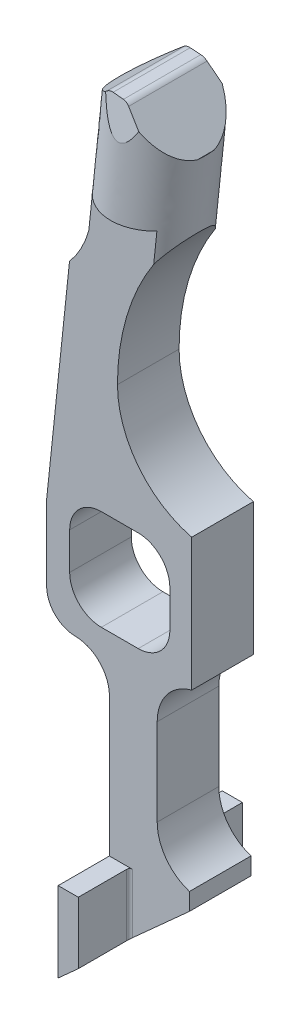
ISO-10303-21;
HEADER;
FILE_DESCRIPTION(('STEP AP214'),'2;1');
FILE_NAME('part.step','',(''),(''),'','','');
FILE_SCHEMA(('AUTOMOTIVE_DESIGN { 1 0 10303 214 1 1 1 1 }'));
ENDSEC;
DATA;
#1=APPLICATION_CONTEXT('core data for automotive mechanical design processes');
#2=APPLICATION_PROTOCOL_DEFINITION('international standard','automotive_design',2000,#1);
#3=PRODUCT_CONTEXT('',#1,'mechanical');
#4=PRODUCT('Part','Part','',(#3));
#5=PRODUCT_RELATED_PRODUCT_CATEGORY('part','',(#4));
#6=PRODUCT_DEFINITION_FORMATION('','',#4);
#7=PRODUCT_DEFINITION_CONTEXT('part definition',#1,'design');
#8=PRODUCT_DEFINITION('design','',#6,#7);
#9=PRODUCT_DEFINITION_SHAPE('','',#8);
#10=(LENGTH_UNIT() NAMED_UNIT(*) SI_UNIT(.MILLI.,.METRE.));
#11=(NAMED_UNIT(*) PLANE_ANGLE_UNIT() SI_UNIT($,.RADIAN.));
#12=(NAMED_UNIT(*) SI_UNIT($,.STERADIAN.) SOLID_ANGLE_UNIT());
#13=UNCERTAINTY_MEASURE_WITH_UNIT(LENGTH_MEASURE(1.E-05),#10,'distance_accuracy_value','');
#14=(GEOMETRIC_REPRESENTATION_CONTEXT(3) GLOBAL_UNCERTAINTY_ASSIGNED_CONTEXT((#13)) GLOBAL_UNIT_ASSIGNED_CONTEXT((#10,
#11,#12)) REPRESENTATION_CONTEXT('',''));
#15=CARTESIAN_POINT('',(0.,0.,0.));
#16=DIRECTION('',(0.,0.,1.));
#17=DIRECTION('',(1.,0.,0.));
#18=AXIS2_PLACEMENT_3D('',#15,#16,#17);
#19=CARTESIAN_POINT('',(1.1642070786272,33.145259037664,0.));
#20=DIRECTION('',(0.,-1.,0.));
#21=DIRECTION('',(0.,0.,-1.));
#22=AXIS2_PLACEMENT_3D('',#19,#20,#21);
#23=CIRCLE('',#22,1.96849999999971);
#24=DIRECTION('',(-0.104528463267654,-0.994521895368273,0.));
#25=VECTOR('',#24,1.);
#26=SURFACE_OF_LINEAR_EXTRUSION('',#23,#25);
#27=CARTESIAN_POINT('',(2.17572497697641,33.1824044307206,-1.69106675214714));
#28=CARTESIAN_POINT('',(2.14580532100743,33.1078676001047,-1.70420960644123));
#29=CARTESIAN_POINT('',(2.11507709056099,33.03363078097,-1.71729956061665));
#30=CARTESIAN_POINT('',(2.0515522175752,32.8859147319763,-1.74334588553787));
#31=CARTESIAN_POINT('',(2.01875306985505,32.8124365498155,-1.75630207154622));
#32=CARTESIAN_POINT('',(1.9508116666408,32.66680508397,-1.78198082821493));
#33=CARTESIAN_POINT('',(1.91567693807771,32.5946484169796,-1.79470399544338));
#34=CARTESIAN_POINT('',(1.84236235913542,32.451879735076,-1.81987796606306));
#35=CARTESIAN_POINT('',(1.80418413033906,32.3812669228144,-1.83232891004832));
#36=CARTESIAN_POINT('',(1.73087463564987,32.2544993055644,-1.85468146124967));
#37=CARTESIAN_POINT('',(1.69638749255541,32.197984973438,-1.86464646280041));
#38=CARTESIAN_POINT('',(1.62368478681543,32.0869257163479,-1.8842292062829));
#39=CARTESIAN_POINT('',(1.58545361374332,32.0323904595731,-1.8938452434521));
#40=CARTESIAN_POINT('',(1.52415943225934,31.9530297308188,-1.90783868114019));
#41=CARTESIAN_POINT('',(1.50293139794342,31.92683433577,-1.91245763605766));
#42=CARTESIAN_POINT('',(1.45895397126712,31.8757207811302,-1.92147033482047));
#43=CARTESIAN_POINT('',(1.436205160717,31.8508021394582,-1.92586416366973));
#44=CARTESIAN_POINT('',(1.38899624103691,31.8028635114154,-1.93431703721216));
#45=CARTESIAN_POINT('',(1.36454827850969,31.7798321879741,-1.93837808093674));
#46=CARTESIAN_POINT('',(1.31346909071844,31.7362897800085,-1.94605578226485));
#47=CARTESIAN_POINT('',(1.28683844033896,31.7157780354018,-1.94967255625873));
#48=CARTESIAN_POINT('',(1.21907227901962,31.6706169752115,-1.957635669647));
#49=CARTESIAN_POINT('',(1.17651788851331,31.6478071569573,-1.9616576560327));
#50=CARTESIAN_POINT('',(1.10844427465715,31.6239337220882,-1.96586718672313));
#51=CARTESIAN_POINT('',(1.08484159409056,31.6176923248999,-1.96696771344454));
#52=CARTESIAN_POINT('',(1.03685824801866,31.6098752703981,-1.96834607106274));
#53=CARTESIAN_POINT('',(1.01247989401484,31.6082868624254,-1.96862615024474));
#54=CARTESIAN_POINT('',(0.966806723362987,31.6102080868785,-1.96828738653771));
#55=CARTESIAN_POINT('',(0.945486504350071,31.6131400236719,-1.9677704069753));
#56=CARTESIAN_POINT('',(0.903771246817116,31.6228785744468,-1.96605323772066));
#57=CARTESIAN_POINT('',(0.883377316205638,31.6296897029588,-1.96485225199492));
#58=CARTESIAN_POINT('',(0.840423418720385,31.6481100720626,-1.96160424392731));
#59=CARTESIAN_POINT('',(0.818157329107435,31.6603724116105,-1.95944206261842));
#60=CARTESIAN_POINT('',(0.775890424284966,31.6882054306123,-1.95453435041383));
#61=CARTESIAN_POINT('',(0.755893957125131,31.7037823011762,-1.95178772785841));
#62=CARTESIAN_POINT('',(0.704073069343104,31.7494961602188,-1.9437271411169));
#63=CARTESIAN_POINT('',(0.674358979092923,31.7819192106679,-1.93801008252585));
#64=CARTESIAN_POINT('',(0.619658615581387,31.8505172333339,-1.92591440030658));
#65=CARTESIAN_POINT('',(0.594699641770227,31.8867121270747,-1.91953226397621));
#66=CARTESIAN_POINT('',(0.553546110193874,31.9529564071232,-1.90785161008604));
#67=CARTESIAN_POINT('',(0.536636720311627,31.9825828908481,-1.90262766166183));
#68=CARTESIAN_POINT('',(0.504585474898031,32.0427552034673,-1.89201765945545));
#69=CARTESIAN_POINT('',(0.489444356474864,32.0733014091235,-1.88663153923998));
#70=CARTESIAN_POINT('',(0.446229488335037,32.165808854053,-1.87031998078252));
#71=CARTESIAN_POINT('',(0.420304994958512,32.2287401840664,-1.85922348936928));
#72=CARTESIAN_POINT('',(0.372377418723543,32.3564445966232,-1.83670575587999));
#73=CARTESIAN_POINT('',(0.35040059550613,32.4212269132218,-1.82528288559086));
#74=CARTESIAN_POINT('',(0.309563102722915,32.5517183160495,-1.80227373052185));
#75=CARTESIAN_POINT('',(0.290702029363,32.6174272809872,-1.79068746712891));
#76=CARTESIAN_POINT('',(0.250905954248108,32.766367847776,-1.76442522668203));
#77=CARTESIAN_POINT('',(0.230675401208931,32.8497804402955,-1.74971733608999));
#78=CARTESIAN_POINT('',(0.202683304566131,32.9748525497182,-1.72766374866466));
#79=CARTESIAN_POINT('',(0.193793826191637,33.0162737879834,-1.72036006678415));
#80=CARTESIAN_POINT('',(0.176671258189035,33.0992466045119,-1.7057297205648));
#81=CARTESIAN_POINT('',(0.168438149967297,33.1407981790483,-1.69840305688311));
#82=CARTESIAN_POINT('',(0.160497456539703,33.1824044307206,-1.69106675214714));
#83=B_SPLINE_CURVE_WITH_KNOTS('',3,(#27,#28,#29,#30,#31,#32,#33,#34,#35,#36,#37,#38,#39,#40,#41,
#42,#43,#44,#45,#46,#47,#48,#49,#50,#51,#52,#53,#54,#55,#56,#57,#58,#59,#60,#61,#62,#63,#64,#65,
#66,#67,#68,#69,#70,#71,#72,#73,#74,#75,#76,#77,#78,#79,#80,#81,#82),.UNSPECIFIED.,.F.,.F.,(4,2,
2,2,2,2,2,2,2,2,2,2,2,2,2,2,2,2,2,2,2,2,2,2,2,2,2,4),(0.,0.244174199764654,0.488649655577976,
0.73237222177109,0.975965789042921,1.17673898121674,1.37838813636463,1.480438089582,
1.58244922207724,1.68379413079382,1.78511243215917,1.92866560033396,2.00160818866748,
2.07435070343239,2.1385366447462,2.2027974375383,2.27890590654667,2.35515780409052,
2.4874604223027,2.6205011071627,2.72396156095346,2.82746498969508,3.03411743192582,
3.24209734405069,3.4500502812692,3.71121983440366,3.84018430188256,3.96914511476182),.UNSPECIFIED.);
#84=CARTESIAN_POINT('',(1.77536455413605,32.3315566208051,-1.84109417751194));
#85=VERTEX_POINT('',#84);
#86=CARTESIAN_POINT('',(0.193340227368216,33.0189600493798,-1.71988640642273));
#87=VERTEX_POINT('',#86);
#88=EDGE_CURVE('E846',#85,#87,#83,.T.);
#89=ORIENTED_EDGE('',*,*,#88,.F.);
#90=CARTESIAN_POINT('',(1.11909665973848,33.081399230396,-1.96812545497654));
#91=CARTESIAN_POINT('',(1.17253678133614,33.020339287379,-1.96928158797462));
#92=CARTESIAN_POINT('',(1.22603059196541,32.959218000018,-1.96772614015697));
#93=CARTESIAN_POINT('',(1.38645500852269,32.7759192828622,-1.9548198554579));
#94=CARTESIAN_POINT('',(1.49313778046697,32.6540250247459,-1.93520536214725));
#95=CARTESIAN_POINT('',(1.70368679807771,32.4134546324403,-1.8734749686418));
#96=CARTESIAN_POINT('',(1.80755223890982,32.2947794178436,-1.83135270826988));
#97=CARTESIAN_POINT('',(2.00999749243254,32.0634682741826,-1.72341061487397));
#98=CARTESIAN_POINT('',(2.10857405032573,31.9508360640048,-1.6575763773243));
#99=CARTESIAN_POINT('',(2.2840152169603,31.7503794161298,-1.51131736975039));
#100=CARTESIAN_POINT('',(2.36201347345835,31.6612596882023,-1.4340681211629));
#101=CARTESIAN_POINT('',(2.49775347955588,31.5061650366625,-1.27202157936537));
#102=CARTESIAN_POINT('',(2.55680296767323,31.4386959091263,-1.18978396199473));
#103=CARTESIAN_POINT('',(2.65760287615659,31.3235233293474,-1.022277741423));
#104=CARTESIAN_POINT('',(2.7006015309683,31.2743936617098,-0.938760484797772));
#105=CARTESIAN_POINT('',(2.77046629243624,31.1945671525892,-0.775309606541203));
#106=CARTESIAN_POINT('',(2.79880199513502,31.1621911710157,-0.696843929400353));
#107=CARTESIAN_POINT('',(2.83476911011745,31.1210956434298,-0.574457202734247));
#108=CARTESIAN_POINT('',(2.84569468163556,31.1086122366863,-0.532729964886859));
#109=CARTESIAN_POINT('',(2.86516065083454,31.0863706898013,-0.447967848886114));
#110=CARTESIAN_POINT('',(2.87369867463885,31.0766152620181,-0.404931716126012));
#111=CARTESIAN_POINT('',(2.88095765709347,31.0683212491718,-0.361373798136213));
#112=B_SPLINE_CURVE_WITH_KNOTS('',3,(#90,#91,#92,#93,#94,#95,#96,#97,#98,#99,#100,#101,#102,
#103,#104,#105,#106,#107,#108,#109,#110,#111),.UNSPECIFIED.,.F.,.F.,(4,2,2,2,2,2,2,2,2,2,4),(0.,
0.243512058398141,0.73140081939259,1.21942751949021,1.70775118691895,2.13006111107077,
2.49340898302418,2.81000749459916,3.07729397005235,3.21185749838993,3.34655434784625),.UNSPECIFIED.);
#113=CARTESIAN_POINT('',(2.88095765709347,31.0683212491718,-0.361373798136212));
#114=VERTEX_POINT('',#113);
#115=EDGE_CURVE('E330',#85,#114,#112,.T.);
#116=ORIENTED_EDGE('',*,*,#115,.T.);
#117=CARTESIAN_POINT('',(2.88095765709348,31.0683212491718,-0.361373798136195));
#118=CARTESIAN_POINT('',(2.89014120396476,31.0724385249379,-0.314536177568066));
#119=CARTESIAN_POINT('',(2.89754794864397,31.0757592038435,-0.267295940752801));
#120=CARTESIAN_POINT('',(2.90869894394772,31.0807585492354,-0.172720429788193));
#121=CARTESIAN_POINT('',(2.91247471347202,31.0824513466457,-0.125389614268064));
#122=CARTESIAN_POINT('',(2.91748369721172,31.0846970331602,-0.00485842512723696));
#123=CARTESIAN_POINT('',(2.91623777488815,31.0841384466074,0.068490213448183));
#124=CARTESIAN_POINT('',(2.90793682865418,31.0804168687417,0.178374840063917));
#125=CARTESIAN_POINT('',(2.90404763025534,31.078673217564,0.215236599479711));
#126=CARTESIAN_POINT('',(2.89411186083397,31.0742186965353,0.28860278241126));
#127=CARTESIAN_POINT('',(2.8880656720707,31.0715079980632,0.325107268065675));
#128=CARTESIAN_POINT('',(2.88095765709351,31.068321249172,0.361373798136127));
#129=B_SPLINE_CURVE_WITH_KNOTS('',3,(#117,#118,#119,#120,#121,#122,#123,#124,#125,#126,#127,
#128),.UNSPECIFIED.,.F.,.F.,(4,2,2,2,2,4),(0.,0.143647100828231,0.286035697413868,
0.505424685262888,0.616682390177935,0.727920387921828),.UNSPECIFIED.);
#130=CARTESIAN_POINT('',(2.88095765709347,31.0683212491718,0.36137379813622));
#131=VERTEX_POINT('',#130);
#132=EDGE_CURVE('E460',#114,#131,#129,.T.);
#133=ORIENTED_EDGE('',*,*,#132,.T.);
#134=CARTESIAN_POINT('',(2.88095765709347,31.0683212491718,0.36137379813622));
#135=CARTESIAN_POINT('',(2.87278674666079,31.0776572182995,0.410435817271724));
#136=CARTESIAN_POINT('',(2.86298326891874,31.0888585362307,0.458843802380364));
#137=CARTESIAN_POINT('',(2.84037337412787,31.1146922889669,0.553948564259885));
#138=CARTESIAN_POINT('',(2.82757084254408,31.1293202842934,0.600647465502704));
#139=CARTESIAN_POINT('',(2.79931411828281,31.1616060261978,0.691700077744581));
#140=CARTESIAN_POINT('',(2.7838815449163,31.1792390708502,0.73606932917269));
#141=CARTESIAN_POINT('',(2.75056370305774,31.217307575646,0.822630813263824));
#142=CARTESIAN_POINT('',(2.73267772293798,31.2377438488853,0.864822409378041));
#143=CARTESIAN_POINT('',(2.67594381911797,31.3025672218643,0.987419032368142));
#144=CARTESIAN_POINT('',(2.63384303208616,31.3506709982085,1.06439936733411));
#145=CARTESIAN_POINT('',(2.54286968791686,31.4546158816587,1.20853802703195));
#146=CARTESIAN_POINT('',(2.49398752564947,31.5104679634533,1.27568213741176));
#147=CARTESIAN_POINT('',(2.41269381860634,31.6033530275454,1.3739608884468));
#148=CARTESIAN_POINT('',(2.38197339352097,31.6384537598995,1.408386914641));
#149=CARTESIAN_POINT('',(2.31908561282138,31.7103084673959,1.47392560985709));
#150=CARTESIAN_POINT('',(2.28691986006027,31.7470606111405,1.50504182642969));
#151=CARTESIAN_POINT('',(2.18857206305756,31.8594314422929,1.59354987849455));
#152=CARTESIAN_POINT('',(2.12050460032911,31.9372043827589,1.64614249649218));
#153=CARTESIAN_POINT('',(1.94250227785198,32.1405873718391,1.76454041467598));
#154=CARTESIAN_POINT('',(1.830083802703,32.2690351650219,1.82176700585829));
#155=CARTESIAN_POINT('',(1.61891139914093,32.5103178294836,1.90160967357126));
#156=CARTESIAN_POINT('',(1.52079249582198,32.6224271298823,1.92825619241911));
#157=CARTESIAN_POINT('',(1.3717414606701,32.7927307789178,1.95407573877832));
#158=CARTESIAN_POINT('',(1.32130662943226,32.8503569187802,1.96031458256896));
#159=CARTESIAN_POINT('',(1.22027545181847,32.9657937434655,1.96788937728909));
#160=CARTESIAN_POINT('',(1.16967909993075,33.023604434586,1.96922515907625));
#161=CARTESIAN_POINT('',(1.11909665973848,33.081399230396,1.96812545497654));
#162=B_SPLINE_CURVE_WITH_KNOTS('',3,(#134,#135,#136,#137,#138,#139,#140,#141,#142,#143,#144,
#145,#146,#147,#148,#149,#150,#151,#152,#153,#154,#155,#156,#157,#158,#159,#160,#161),
.UNSPECIFIED.,.F.,.F.,(4,2,2,2,2,2,2,2,2,2,2,2,2,4),(0.,0.151716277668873,0.303237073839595,
0.453567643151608,0.603941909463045,0.90286759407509,1.20222108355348,1.37601715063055,
1.54962502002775,1.89664076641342,2.43402006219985,2.88679894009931,3.11715843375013,
3.34752587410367),.UNSPECIFIED.);
#163=CARTESIAN_POINT('',(1.77536455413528,32.3315566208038,1.84109417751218));
#164=VERTEX_POINT('',#163);
#165=EDGE_CURVE('E451',#131,#164,#162,.T.);
#166=ORIENTED_EDGE('',*,*,#165,.T.);
#167=CARTESIAN_POINT('',(0.160497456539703,33.1824044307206,1.69106675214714));
#168=CARTESIAN_POINT('',(0.174330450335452,33.1100631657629,1.70382246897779));
#169=CARTESIAN_POINT('',(0.189007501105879,33.0378622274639,1.71655344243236));
#170=CARTESIAN_POINT('',(0.220548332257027,32.8938081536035,1.74195406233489));
#171=CARTESIAN_POINT('',(0.237415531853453,32.8219557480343,1.75462358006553));
#172=CARTESIAN_POINT('',(0.273603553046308,32.6796468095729,1.77971648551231));
#173=CARTESIAN_POINT('',(0.292896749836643,32.6091835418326,1.79214106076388));
#174=CARTESIAN_POINT('',(0.334781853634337,32.4692452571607,1.81681595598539));
#175=CARTESIAN_POINT('',(0.357371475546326,32.3997695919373,1.82906639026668));
#176=CARTESIAN_POINT('',(0.400080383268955,32.2814913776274,1.84992203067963));
#177=CARTESIAN_POINT('',(0.41913639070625,32.2323185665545,1.85859252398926));
#178=CARTESIAN_POINT('',(0.460377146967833,32.1347952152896,1.87578852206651));
#179=CARTESIAN_POINT('',(0.482584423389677,32.0864536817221,1.88431243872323));
#180=CARTESIAN_POINT('',(0.522366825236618,32.0087059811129,1.89802145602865));
#181=CARTESIAN_POINT('',(0.538755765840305,31.9787142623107,1.90330980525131));
#182=CARTESIAN_POINT('',(0.57362666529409,31.9198656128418,1.91368640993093));
#183=CARTESIAN_POINT('',(0.59211118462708,31.8910101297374,1.91877441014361));
#184=CARTESIAN_POINT('',(0.631492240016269,31.8353264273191,1.92859294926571));
#185=CARTESIAN_POINT('',(0.652363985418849,31.808481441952,1.93332644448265));
#186=CARTESIAN_POINT('',(0.697284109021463,31.7575490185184,1.94230720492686));
#187=CARTESIAN_POINT('',(0.721321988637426,31.7334529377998,1.94655599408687));
#188=CARTESIAN_POINT('',(0.764163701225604,31.6973591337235,1.95292030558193));
#189=CARTESIAN_POINT('',(0.781844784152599,31.6840828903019,1.95526126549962));
#190=CARTESIAN_POINT('',(0.818946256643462,31.6600938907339,1.95949117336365));
#191=CARTESIAN_POINT('',(0.838366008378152,31.6493801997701,1.96138028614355));
#192=CARTESIAN_POINT('',(0.879051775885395,31.6312408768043,1.9645787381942));
#193=CARTESIAN_POINT('',(0.900337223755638,31.6238564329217,1.96588081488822));
#194=CARTESIAN_POINT('',(0.943961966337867,31.613339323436,1.96773526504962));
#195=CARTESIAN_POINT('',(0.966299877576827,31.6102012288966,1.96828859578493));
#196=CARTESIAN_POINT('',(1.00843297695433,31.6084825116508,1.96859165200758));
#197=CARTESIAN_POINT('',(1.02820954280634,31.6093973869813,1.96843033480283));
#198=CARTESIAN_POINT('',(1.06734707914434,31.6143735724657,1.96755289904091));
#199=CARTESIAN_POINT('',(1.08670762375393,31.6184379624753,1.9668362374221));
#200=CARTESIAN_POINT('',(1.16008011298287,31.6392457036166,1.96316727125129));
#201=CARTESIAN_POINT('',(1.21128926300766,31.6654926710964,1.95853922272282));
#202=CARTESIAN_POINT('',(1.28053168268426,31.7115458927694,1.95041879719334));
#203=CARTESIAN_POINT('',(1.30182220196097,31.727452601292,1.94761401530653));
#204=CARTESIAN_POINT('',(1.34297336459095,31.7609809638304,1.94170206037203));
#205=CARTESIAN_POINT('',(1.36283622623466,31.7785998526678,1.9385953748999));
#206=CARTESIAN_POINT('',(1.40137376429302,31.8151553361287,1.9321496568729));
#207=CARTESIAN_POINT('',(1.42004378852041,31.8340965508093,1.92880980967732));
#208=CARTESIAN_POINT('',(1.4563193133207,31.8729517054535,1.92195859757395));
#209=CARTESIAN_POINT('',(1.47392449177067,31.8928659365,1.91844718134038));
#210=CARTESIAN_POINT('',(1.52049800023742,31.9479789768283,1.90872926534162));
#211=CARTESIAN_POINT('',(1.54857249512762,31.9839081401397,1.90239398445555));
#212=CARTESIAN_POINT('',(1.60260326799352,32.0572893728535,1.88945489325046));
#213=CARTESIAN_POINT('',(1.62855825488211,32.094742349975,1.88285092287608));
#214=CARTESIAN_POINT('',(1.67878554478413,32.1708107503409,1.86943801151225));
#215=CARTESIAN_POINT('',(1.70305494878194,32.2094280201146,1.86262874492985));
#216=CARTESIAN_POINT('',(1.75016370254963,32.2875024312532,1.84886211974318));
#217=CARTESIAN_POINT('',(1.77300281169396,32.3269597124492,1.84190473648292));
#218=CARTESIAN_POINT('',(1.83986273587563,32.4465579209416,1.82081634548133));
#219=CARTESIAN_POINT('',(1.88207020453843,32.5276816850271,1.80651203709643));
#220=CARTESIAN_POINT('',(1.96284632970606,32.6915377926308,1.77761978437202));
#221=CARTESIAN_POINT('',(2.00141865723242,32.774268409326,1.76303214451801));
#222=CARTESIAN_POINT('',(2.06258554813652,32.9114498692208,1.73884335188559));
#223=CARTESIAN_POINT('',(2.08600365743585,32.9655473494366,1.7293045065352));
#224=CARTESIAN_POINT('',(2.13166611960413,33.0738431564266,1.71020903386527));
#225=CARTESIAN_POINT('',(2.15391663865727,33.1280389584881,1.70065285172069));
#226=CARTESIAN_POINT('',(2.17572497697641,33.1824044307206,1.69106675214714));
#227=B_SPLINE_CURVE_WITH_KNOTS('',3,(#167,#168,#169,#170,#171,#172,#173,#174,#175,#176,#177,
#178,#179,#180,#181,#182,#183,#184,#185,#186,#187,#188,#189,#190,#191,#192,#193,#194,#195,#196,
#197,#198,#199,#200,#201,#202,#203,#204,#205,#206,#207,#208,#209,#210,#211,#212,#213,#214,#215,
#216,#217,#218,#219,#220,#221,#222,#223,#224,#225,#226),.UNSPECIFIED.,.F.,.F.,(4,2,2,2,2,2,2,2,
2,2,2,2,2,2,2,2,2,2,2,2,2,2,2,2,2,2,2,2,2,4),(0.,0.224264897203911,0.448884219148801,
0.671144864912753,0.893252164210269,1.05352092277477,1.2149992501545,1.31869239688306,
1.42251363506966,1.52534075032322,1.62783510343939,1.69436794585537,1.76087647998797,
1.82818665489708,1.89541069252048,1.95451844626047,2.01368407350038,2.18333097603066,
2.26353993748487,2.34362144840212,2.42399829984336,2.50439934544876,2.64239337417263,
2.78047084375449,2.91878019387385,3.05711275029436,3.33465331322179,3.61191052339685,
3.79104676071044,3.96911485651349),.UNSPECIFIED.);
#228=CARTESIAN_POINT('',(0.193340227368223,33.0189600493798,1.71988640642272));
#229=VERTEX_POINT('',#228);
#230=EDGE_CURVE('E366',#229,#164,#227,.T.);
#231=ORIENTED_EDGE('',*,*,#230,.F.);
#232=CARTESIAN_POINT('',(0.35977727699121,33.145259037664,-1.79663155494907));
#233=CARTESIAN_POINT('',(0.298165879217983,33.0985058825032,-1.7712256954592));
#234=CARTESIAN_POINT('',(0.237327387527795,33.0523392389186,-1.7429525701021));
#235=CARTESIAN_POINT('',(0.117534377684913,32.961435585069,-1.68035328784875));
#236=CARTESIAN_POINT('',(0.058583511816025,32.9167013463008,-1.64601614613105));
#237=CARTESIAN_POINT('',(-0.101836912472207,32.794968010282,-1.54186549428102));
#238=CARTESIAN_POINT('',(-0.200653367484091,32.7199821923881,-1.46525357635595));
#239=CARTESIAN_POINT('',(-0.332782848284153,32.6197171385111,-1.34128346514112));
#240=CARTESIAN_POINT('',(-0.371193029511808,32.5905699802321,-1.30230699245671));
#241=CARTESIAN_POINT('',(-0.445409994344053,32.5342512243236,-1.22048468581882));
#242=CARTESIAN_POINT('',(-0.481212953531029,32.507082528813,-1.17763336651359));
#243=CARTESIAN_POINT('',(-0.575711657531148,32.435373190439,-1.05405186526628));
#244=CARTESIAN_POINT('',(-0.631140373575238,32.3933116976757,-0.969272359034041));
#245=CARTESIAN_POINT('',(-0.729089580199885,32.3189839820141,-0.788591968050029));
#246=CARTESIAN_POINT('',(-0.771621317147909,32.2867092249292,-0.692700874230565));
#247=CARTESIAN_POINT('',(-0.832564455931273,32.2404631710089,-0.515001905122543));
#248=CARTESIAN_POINT('',(-0.854265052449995,32.2239959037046,-0.434972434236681));
#249=CARTESIAN_POINT('',(-0.886658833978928,32.1994142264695,-0.271489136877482));
#250=CARTESIAN_POINT('',(-0.897361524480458,32.1912926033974,-0.188038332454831));
#251=CARTESIAN_POINT('',(-0.907034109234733,32.1839526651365,-0.0198693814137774));
#252=CARTESIAN_POINT('',(-0.905977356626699,32.1847545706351,0.0648512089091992));
#253=CARTESIAN_POINT('',(-0.892144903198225,32.1952511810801,0.232782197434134));
#254=CARTESIAN_POINT('',(-0.879364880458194,32.2049491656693,0.315992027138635));
#255=CARTESIAN_POINT('',(-0.843492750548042,32.2321703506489,0.476219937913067));
#256=CARTESIAN_POINT('',(-0.820704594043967,32.249462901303,0.553346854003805));
#257=CARTESIAN_POINT('',(-0.766212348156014,32.2908137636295,0.702368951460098));
#258=CARTESIAN_POINT('',(-0.734510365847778,32.3148704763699,0.774265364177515));
#259=CARTESIAN_POINT('',(-0.650796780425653,32.3783956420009,0.936791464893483));
#260=CARTESIAN_POINT('',(-0.595584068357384,32.4202932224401,1.02482418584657));
#261=CARTESIAN_POINT('',(-0.474235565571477,32.5123772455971,1.1891249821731));
#262=CARTESIAN_POINT('',(-0.408016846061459,32.5626266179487,1.26529451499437));
#263=CARTESIAN_POINT('',(-0.267491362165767,32.6692628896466,1.40538147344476));
#264=CARTESIAN_POINT('',(-0.193155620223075,32.7256717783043,1.46925259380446));
#265=CARTESIAN_POINT('',(-0.0408186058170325,32.8412711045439,1.58330363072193));
#266=CARTESIAN_POINT('',(0.0370347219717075,32.9003492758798,1.63379961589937));
#267=CARTESIAN_POINT('',(0.196119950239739,33.0210694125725,1.72341936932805));
#268=CARTESIAN_POINT('',(0.277322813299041,33.0826893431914,1.76262399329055));
#269=CARTESIAN_POINT('',(0.359777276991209,33.145259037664,1.79663155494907));
#270=B_SPLINE_CURVE_WITH_KNOTS('',3,(#232,#233,#234,#235,#236,#237,#238,#239,#240,#241,#242,
#243,#244,#245,#246,#247,#248,#249,#250,#251,#252,#253,#254,#255,#256,#257,#258,#259,#260,#261,
#262,#263,#264,#265,#266,#267,#268,#269),.UNSPECIFIED.,.F.,.F.,(4,2,2,2,2,2,2,2,2,2,2,2,2,2,2,2,
2,2,4),(0.,0.244094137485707,0.488635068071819,0.92368013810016,1.10951729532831,
1.29562177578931,1.62308154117,1.95025492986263,2.20278230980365,2.45509124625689,
2.70797203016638,2.96094607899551,3.20671779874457,3.45243147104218,3.78677416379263,
4.12376090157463,4.46199264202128,4.7913233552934,5.11823355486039),.UNSPECIFIED.);
#271=EDGE_CURVE('E365',#87,#229,#270,.T.);
#272=ORIENTED_EDGE('',*,*,#271,.F.);
#273=EDGE_LOOP('',(#89,#116,#133,#166,#231,#272));
#274=FACE_BOUND('',#273,.T.);
#275=CARTESIAN_POINT('',(-0.771919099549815,28.448,-1.33955373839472));
#276=CARTESIAN_POINT('',(-0.770468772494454,28.4310367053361,-1.34303203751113));
#277=CARTESIAN_POINT('',(-0.769120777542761,28.4140418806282,-1.34638337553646));
#278=CARTESIAN_POINT('',(-0.766629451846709,28.3799891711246,-1.35283212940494));
#279=CARTESIAN_POINT('',(-0.765486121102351,28.3629312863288,-1.35592954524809));
#280=CARTESIAN_POINT('',(-0.76444512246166,28.3458418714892,-1.35890000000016));
#281=B_SPLINE_CURVE_WITH_KNOTS('',3,(#275,#276,#277,#278,#279,#280),.UNSPECIFIED.,.F.,.F.,(4,2,
4),(0.,0.0521234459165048,0.10424689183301),.UNSPECIFIED.);
#282=CARTESIAN_POINT('',(-0.771919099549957,28.448,-1.33955373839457));
#283=VERTEX_POINT('',#282);
#284=CARTESIAN_POINT('',(-0.764445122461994,28.3458418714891,-1.3589));
#285=VERTEX_POINT('',#284);
#286=EDGE_CURVE('E561',#283,#285,#281,.T.);
#287=ORIENTED_EDGE('',*,*,#286,.T.);
#288=DIRECTION('',(-0.104528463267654,-0.994521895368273,0.));
#289=VECTOR('',#288,1.);
#290=CARTESIAN_POINT('',(-0.753707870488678,28.448,-1.3589));
#291=LINE('',#290,#289);
#292=CARTESIAN_POINT('',(-0.908748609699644,26.9728859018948,-1.3589));
#293=VERTEX_POINT('',#292);
#294=EDGE_CURVE('E825',#285,#293,#291,.T.);
#295=ORIENTED_EDGE('',*,*,#294,.T.);
#296=CARTESIAN_POINT('',(-0.908748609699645,26.9728859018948,-1.3589));
#297=CARTESIAN_POINT('',(-0.925402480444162,26.9127285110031,-1.34804554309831));
#298=CARTESIAN_POINT('',(-0.943351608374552,26.8532000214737,-1.33556869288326));
#299=CARTESIAN_POINT('',(-0.981615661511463,26.7356775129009,-1.30696736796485));
#300=CARTESIAN_POINT('',(-1.00193493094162,26.6776865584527,-1.2908361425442));
#301=CARTESIAN_POINT('',(-1.0448963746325,26.5630871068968,-1.25435210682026));
#302=CARTESIAN_POINT('',(-1.06756259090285,26.5065022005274,-1.23395284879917));
#303=CARTESIAN_POINT('',(-1.1145839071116,26.3959797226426,-1.18859640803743));
#304=CARTESIAN_POINT('',(-1.13893759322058,26.3420399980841,-1.16364301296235));
#305=CARTESIAN_POINT('',(-1.19870053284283,26.2165920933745,-1.09774765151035));
#306=CARTESIAN_POINT('',(-1.23466910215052,26.1465843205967,-1.05438713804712));
#307=CARTESIAN_POINT('',(-1.30657317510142,26.0151494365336,-0.956591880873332));
#308=CARTESIAN_POINT('',(-1.3425081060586,25.9536853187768,-0.902207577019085));
#309=CARTESIAN_POINT('',(-1.40408244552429,25.8534949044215,-0.794311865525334));
#310=CARTESIAN_POINT('',(-1.43029132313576,25.8127093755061,-0.743051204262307));
#311=CARTESIAN_POINT('',(-1.47896323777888,25.7393137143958,-0.633273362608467));
#312=CARTESIAN_POINT('',(-1.50142536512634,25.7067055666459,-0.574754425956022));
#313=CARTESIAN_POINT('',(-1.54071949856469,25.6509127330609,-0.450917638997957));
#314=CARTESIAN_POINT('',(-1.55750204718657,25.6278104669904,-0.385546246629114));
#315=CARTESIAN_POINT('',(-1.58329756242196,25.5927086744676,-0.25043089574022));
#316=CARTESIAN_POINT('',(-1.59231834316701,25.5806979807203,-0.180691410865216));
#317=CARTESIAN_POINT('',(-1.60085455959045,25.5693414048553,-0.0498206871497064));
#318=CARTESIAN_POINT('',(-1.60155273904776,25.5684194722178,0.0111023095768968));
#319=CARTESIAN_POINT('',(-1.59642525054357,25.575230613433,0.132171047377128));
#320=CARTESIAN_POINT('',(-1.59060163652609,25.5829609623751,0.19231702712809));
#321=CARTESIAN_POINT('',(-1.57341213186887,25.6061279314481,0.307043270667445));
#322=CARTESIAN_POINT('',(-1.56233891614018,25.6211585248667,0.36175138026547));
#323=CARTESIAN_POINT('',(-1.53564824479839,25.6581418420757,0.467582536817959));
#324=CARTESIAN_POINT('',(-1.52002984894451,25.6800959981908,0.518704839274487));
#325=CARTESIAN_POINT('',(-1.48395387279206,25.7321577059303,0.62033804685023));
#326=CARTESIAN_POINT('',(-1.4632134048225,25.7627685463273,0.670488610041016));
#327=CARTESIAN_POINT('',(-1.41908763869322,25.8301583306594,0.765088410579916));
#328=CARTESIAN_POINT('',(-1.39570214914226,25.866937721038,0.80953723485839));
#329=CARTESIAN_POINT('',(-1.3350524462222,25.9661675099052,0.914279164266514));
#330=CARTESIAN_POINT('',(-1.29688526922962,26.0320330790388,0.970819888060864));
#331=CARTESIAN_POINT('',(-1.22082271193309,26.1730270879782,1.07176710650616));
#332=CARTESIAN_POINT('',(-1.18292983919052,26.2482027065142,1.11610779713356));
#333=CARTESIAN_POINT('',(-1.123266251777,26.3766515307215,1.17980569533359));
#334=CARTESIAN_POINT('',(-1.1006333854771,26.4279778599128,1.20239102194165));
#335=CARTESIAN_POINT('',(-1.05693596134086,26.5328837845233,1.24359884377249));
#336=CARTESIAN_POINT('',(-1.03587233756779,26.5864646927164,1.2622189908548));
#337=CARTESIAN_POINT('',(-0.995907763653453,26.6947638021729,1.29565925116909));
#338=CARTESIAN_POINT('',(-0.976983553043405,26.7494601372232,1.31052297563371));
#339=CARTESIAN_POINT('',(-0.941243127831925,26.8602144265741,1.33703457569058));
#340=CARTESIAN_POINT('',(-0.924423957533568,26.9162703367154,1.3486869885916));
#341=CARTESIAN_POINT('',(-0.908748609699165,26.9728859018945,1.35890000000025));
#342=B_SPLINE_CURVE_WITH_KNOTS('',3,(#296,#297,#298,#299,#300,#301,#302,#303,#304,#305,#306,
#307,#308,#309,#310,#311,#312,#313,#314,#315,#316,#317,#318,#319,#320,#321,#322,#323,#324,#325,
#326,#327,#328,#329,#330,#331,#332,#333,#334,#335,#336,#337,#338,#339,#340,#341),.UNSPECIFIED.,
.F.,.F.,(4,2,2,2,2,2,2,2,2,2,2,2,2,2,2,2,2,2,2,2,2,2,4),(0.,0.190064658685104,0.380483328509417,
0.573093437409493,0.765544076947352,1.03419678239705,1.30164693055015,1.51249957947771,
1.72340334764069,1.93609904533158,2.14858036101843,2.33043270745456,2.51222779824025,
2.68490339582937,2.85761473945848,3.04383021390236,3.23005917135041,3.51295806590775,
3.79735420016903,3.97858737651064,4.15992758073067,4.33905422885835,4.51792647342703),.UNSPECIFIED.);
#343=CARTESIAN_POINT('',(-0.908748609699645,26.9728859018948,1.3589));
#344=VERTEX_POINT('',#343);
#345=EDGE_CURVE('E571',#293,#344,#342,.T.);
#346=ORIENTED_EDGE('',*,*,#345,.T.);
#347=DIRECTION('',(-0.104528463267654,-0.994521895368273,0.));
#348=VECTOR('',#347,1.);
#349=CARTESIAN_POINT('',(-0.753707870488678,28.448,1.3589));
#350=LINE('',#349,#348);
#351=CARTESIAN_POINT('',(-0.764445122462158,28.3458418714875,1.3589));
#352=VERTEX_POINT('',#351);
#353=EDGE_CURVE('E413',#352,#344,#350,.T.);
#354=ORIENTED_EDGE('',*,*,#353,.F.);
#355=CARTESIAN_POINT('',(-0.764445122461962,28.3458418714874,1.35890000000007));
#356=CARTESIAN_POINT('',(-0.765486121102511,28.3629312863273,1.35592954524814));
#357=CARTESIAN_POINT('',(-0.766629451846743,28.3799891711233,1.35283212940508));
#358=CARTESIAN_POINT('',(-0.769120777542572,28.4140418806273,1.34638337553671));
#359=CARTESIAN_POINT('',(-0.77046877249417,28.4310367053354,1.34303203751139));
#360=CARTESIAN_POINT('',(-0.771919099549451,28.4479999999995,1.33955373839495));
#361=B_SPLINE_CURVE_WITH_KNOTS('',3,(#355,#356,#357,#358,#359,#360),.UNSPECIFIED.,.F.,.F.,(4,2,
4),(0.,0.0521234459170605,0.104246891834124),.UNSPECIFIED.);
#362=CARTESIAN_POINT('',(-0.771919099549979,28.448,1.33955373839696));
#363=VERTEX_POINT('',#362);
#364=EDGE_CURVE('E567',#352,#363,#361,.T.);
#365=ORIENTED_EDGE('',*,*,#364,.T.);
#366=CARTESIAN_POINT('',(-0.771919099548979,28.4479999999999,1.33955373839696));
#367=CARTESIAN_POINT('',(-0.768905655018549,28.448,1.34279859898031));
#368=CARTESIAN_POINT('',(-0.765881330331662,28.448,1.34603321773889));
#369=CARTESIAN_POINT('',(-0.759810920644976,28.448,1.35248197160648));
#370=CARTESIAN_POINT('',(-0.756764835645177,28.448,1.3556961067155));
#371=CARTESIAN_POINT('',(-0.753707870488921,28.448,1.35889999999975));
#372=B_SPLINE_CURVE_WITH_KNOTS('',3,(#366,#367,#368,#369,#370,#371),.UNSPECIFIED.,.F.,.F.,(4,2,
4),(0.,0.0132847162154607,0.0265694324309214),.UNSPECIFIED.);
#373=CARTESIAN_POINT('',(-0.753707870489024,28.448,1.35889999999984));
#374=VERTEX_POINT('',#373);
#375=EDGE_CURVE('E468',#363,#374,#372,.T.);
#376=ORIENTED_EDGE('',*,*,#375,.T.);
#377=CARTESIAN_POINT('',(0.67050525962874,28.448,0.));
#378=DIRECTION('',(0.,-1.,0.));
#379=DIRECTION('',(0.,0.,-1.));
#380=AXIS2_PLACEMENT_3D('',#377,#378,#379);
#381=CIRCLE('',#380,1.96849999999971);
#382=CARTESIAN_POINT('',(1.37749225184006,28.448,1.83716130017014));
#383=VERTEX_POINT('',#382);
#384=EDGE_CURVE('E416',#383,#374,#381,.T.);
#385=ORIENTED_EDGE('',*,*,#384,.F.);
#386=CARTESIAN_POINT('',(-0.753707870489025,28.448,1.35889999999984));
#387=CARTESIAN_POINT('',(-0.716038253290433,28.448,1.39837961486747));
#388=CARTESIAN_POINT('',(-0.676744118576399,28.448,1.43627405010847));
#389=CARTESIAN_POINT('',(-0.595149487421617,28.448,1.50867094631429));
#390=CARTESIAN_POINT('',(-0.552849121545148,28.448,1.54317355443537));
#391=CARTESIAN_POINT('',(-0.421871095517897,28.448,1.64121112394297));
#392=CARTESIAN_POINT('',(-0.329052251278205,28.448,1.69934305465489));
#393=CARTESIAN_POINT('',(-0.1351191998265,28.448,1.79941201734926));
#394=CARTESIAN_POINT('',(-0.0340049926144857,28.448,1.84134904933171));
#395=CARTESIAN_POINT('',(0.17378197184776,28.448,1.90791847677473));
#396=CARTESIAN_POINT('',(0.280454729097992,28.448,1.9325508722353));
#397=CARTESIAN_POINT('',(0.496402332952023,28.448,1.96381921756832));
#398=CARTESIAN_POINT('',(0.605677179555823,28.448,1.97045516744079));
#399=CARTESIAN_POINT('',(0.823820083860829,28.448,1.96555030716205));
#400=CARTESIAN_POINT('',(0.932688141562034,28.448,1.95400949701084));
#401=CARTESIAN_POINT('',(1.14700873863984,28.448,1.91307098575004));
#402=CARTESIAN_POINT('',(1.25246127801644,28.448,1.88367328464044));
#403=CARTESIAN_POINT('',(1.45706124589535,28.448,1.80782287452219));
#404=CARTESIAN_POINT('',(1.55620867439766,28.448,1.76137016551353));
#405=CARTESIAN_POINT('',(1.73178114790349,28.448,1.66054279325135));
#406=CARTESIAN_POINT('',(1.80942281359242,28.448,1.60827023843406));
#407=CARTESIAN_POINT('',(1.95808106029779,28.448,1.49206919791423));
#408=CARTESIAN_POINT('',(2.02892464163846,28.448,1.42791934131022));
#409=CARTESIAN_POINT('',(2.09471838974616,28.448,1.3589));
#410=B_SPLINE_CURVE_WITH_KNOTS('',3,(#386,#387,#388,#389,#390,#391,#392,#393,#394,#395,#396,
#397,#398,#399,#400,#401,#402,#403,#404,#405,#406,#407,#408,#409),.UNSPECIFIED.,.F.,.F.,(4,2,2,
2,2,2,2,2,2,2,2,4),(0.,0.163605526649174,0.327203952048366,0.65412527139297,0.981046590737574,
1.30796791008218,1.63488922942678,1.96181054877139,2.28873186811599,2.61565318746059,
2.89552694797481,3.18126766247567),.UNSPECIFIED.);
#411=CARTESIAN_POINT('',(2.09471838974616,28.448,1.3589));
#412=VERTEX_POINT('',#411);
#413=EDGE_CURVE('E420',#383,#412,#410,.T.);
#414=ORIENTED_EDGE('',*,*,#413,.T.);
#415=DIRECTION('',(-0.104528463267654,-0.994521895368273,0.));
#416=VECTOR('',#415,1.);
#417=CARTESIAN_POINT('',(2.58842020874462,33.145259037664,1.3589));
#418=LINE('',#417,#416);
#419=CARTESIAN_POINT('',(1.95443349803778,27.1132784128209,1.3589));
#420=VERTEX_POINT('',#419);
#421=EDGE_CURVE('E423',#420,#412,#418,.F.);
#422=ORIENTED_EDGE('',*,*,#421,.F.);
#423=CARTESIAN_POINT('',(1.05406334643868,25.370779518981,-1.83716130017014));
#424=CARTESIAN_POINT('',(1.08386980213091,25.4458964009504,-1.82872139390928));
#425=CARTESIAN_POINT('',(1.11457039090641,25.5205763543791,-1.81948482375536));
#426=CARTESIAN_POINT('',(1.17770116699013,25.6689759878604,-1.7991151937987));
#427=CARTESIAN_POINT('',(1.21013206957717,25.7426952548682,-1.78798134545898));
#428=CARTESIAN_POINT('',(1.27673295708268,25.8892291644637,-1.76348628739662));
#429=CARTESIAN_POINT('',(1.31090755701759,25.9620406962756,-1.75011892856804));
#430=CARTESIAN_POINT('',(1.38080050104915,26.1063810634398,-1.72082425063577));
#431=CARTESIAN_POINT('',(1.4165185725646,26.1779101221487,-1.7048973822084));
#432=CARTESIAN_POINT('',(1.50634718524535,26.3525148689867,-1.66196805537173));
#433=CARTESIAN_POINT('',(1.56127443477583,26.4547635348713,-1.63326242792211));
#434=CARTESIAN_POINT('',(1.67352321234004,26.6553146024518,-1.56799729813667));
#435=CARTESIAN_POINT('',(1.73084280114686,26.7536200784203,-1.53144406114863));
#436=CARTESIAN_POINT('',(1.83033684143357,26.9178708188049,-1.46044780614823));
#437=CARTESIAN_POINT('',(1.87216715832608,26.9850475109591,-1.42837744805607));
#438=CARTESIAN_POINT('',(1.9559745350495,27.1162095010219,-1.3585075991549));
#439=CARTESIAN_POINT('',(1.99795144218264,27.1801974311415,-1.32071294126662));
#440=CARTESIAN_POINT('',(2.07140877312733,27.2895088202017,-1.2482708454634));
#441=CARTESIAN_POINT('',(2.10301640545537,27.3356583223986,-1.21500457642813));
#442=CARTESIAN_POINT('',(2.16546227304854,27.4252732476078,-1.14416185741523));
#443=CARTESIAN_POINT('',(2.19629891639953,27.4687333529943,-1.10657726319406));
#444=CARTESIAN_POINT('',(2.27483084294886,27.5776448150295,-1.00253680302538));
#445=CARTESIAN_POINT('',(2.32142241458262,27.6404691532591,-0.932383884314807));
#446=CARTESIAN_POINT('',(2.40736975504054,27.7539666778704,-0.778952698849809));
#447=CARTESIAN_POINT('',(2.44674484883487,27.8046724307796,-0.695710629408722));
#448=CARTESIAN_POINT('',(2.50149076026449,27.8741707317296,-0.549177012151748));
#449=CARTESIAN_POINT('',(2.52039512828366,27.897875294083,-0.489536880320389));
#450=CARTESIAN_POINT('',(2.55201316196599,27.9372689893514,-0.366092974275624));
#451=CARTESIAN_POINT('',(2.56473225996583,27.9529651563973,-0.302292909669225));
#452=CARTESIAN_POINT('',(2.58293528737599,27.975367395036,-0.171698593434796));
#453=CARTESIAN_POINT('',(2.58837634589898,27.9820202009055,-0.104888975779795));
#454=CARTESIAN_POINT('',(2.59133358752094,27.9856407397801,0.0291693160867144));
#455=CARTESIAN_POINT('',(2.58885107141,27.9826100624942,0.0964179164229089));
#456=CARTESIAN_POINT('',(2.57674945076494,27.9677586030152,0.223550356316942));
#457=CARTESIAN_POINT('',(2.56773712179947,27.9566849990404,0.283583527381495));
#458=CARTESIAN_POINT('',(2.54399247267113,27.927291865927,0.400642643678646));
#459=CARTESIAN_POINT('',(2.52925833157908,27.9089700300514,0.457667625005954));
#460=CARTESIAN_POINT('',(2.48937000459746,27.8588727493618,0.586004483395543));
#461=CARTESIAN_POINT('',(2.46238082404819,27.8246510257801,0.65578882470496));
#462=CARTESIAN_POINT('',(2.40241842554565,27.7472989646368,0.787385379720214));
#463=CARTESIAN_POINT('',(2.36943326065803,27.7041508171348,0.849181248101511));
#464=CARTESIAN_POINT('',(2.28320481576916,27.5890782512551,0.991991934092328));
#465=CARTESIAN_POINT('',(2.22772274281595,27.5131561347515,1.06840306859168));
#466=CARTESIAN_POINT('',(2.11325845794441,27.3511167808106,1.20608546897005));
#467=CARTESIAN_POINT('',(2.0542706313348,27.2649829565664,1.26733159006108));
#468=CARTESIAN_POINT('',(1.94403996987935,27.0980422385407,1.36953673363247));
#469=CARTESIAN_POINT('',(1.8928654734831,27.0181702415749,1.41213425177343));
#470=CARTESIAN_POINT('',(1.79129866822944,26.8543265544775,1.48948345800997));
#471=CARTESIAN_POINT('',(1.74090615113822,26.7703559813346,1.52423726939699));
#472=CARTESIAN_POINT('',(1.63180249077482,26.582130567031,1.5934867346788));
#473=CARTESIAN_POINT('',(1.57342899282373,26.4771616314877,1.62655778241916));
#474=CARTESIAN_POINT('',(1.45970782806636,26.2634507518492,1.68521812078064));
#475=CARTESIAN_POINT('',(1.40436354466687,26.1547048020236,1.71079917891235));
#476=CARTESIAN_POINT('',(1.2975107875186,25.9346805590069,1.75586945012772));
#477=CARTESIAN_POINT('',(1.24598820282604,25.8234137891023,1.77538202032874));
#478=CARTESIAN_POINT('',(1.14697036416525,25.5986829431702,1.80957739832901));
#479=CARTESIAN_POINT('',(1.09946597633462,25.4852246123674,1.82427139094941));
#480=CARTESIAN_POINT('',(1.05406334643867,25.370779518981,1.83716130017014));
#481=B_SPLINE_CURVE_WITH_KNOTS('',3,(#423,#424,#425,#426,#427,#428,#429,#430,#431,#432,#433,
#434,#435,#436,#437,#438,#439,#440,#441,#442,#443,#444,#445,#446,#447,#448,#449,#450,#451,#452,
#453,#454,#455,#456,#457,#458,#459,#460,#461,#462,#463,#464,#465,#466,#467,#468,#469,#470,#471,
#472,#473,#474,#475,#476,#477,#478,#479,#480),.UNSPECIFIED.,.F.,.F.,(4,2,2,2,2,2,2,2,2,2,2,2,2,
2,2,2,2,2,2,2,2,2,2,2,2,2,2,2,4),(0.,0.243761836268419,0.487625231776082,0.732171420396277,
0.976674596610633,1.33507994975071,1.69320021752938,1.94915995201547,2.20490477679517,
2.39996588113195,2.59540109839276,2.90922928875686,3.22220439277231,3.42215367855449,
3.62192703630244,3.82287204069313,4.02378405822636,4.20809127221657,4.39245718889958,
4.63791718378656,4.88387172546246,5.24533551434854,5.6073946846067,5.91891142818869,
6.23034374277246,6.6036835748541,6.97743222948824,7.34972402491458,7.721145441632),.UNSPECIFIED.);
#482=CARTESIAN_POINT('',(1.95443349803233,27.1132784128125,-1.3589));
#483=VERTEX_POINT('',#482);
#484=EDGE_CURVE('E430',#483,#420,#481,.T.);
#485=ORIENTED_EDGE('',*,*,#484,.F.);
#486=DIRECTION('',(-0.104528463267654,-0.994521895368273,0.));
#487=VECTOR('',#486,1.);
#488=CARTESIAN_POINT('',(2.58842020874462,33.145259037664,-1.3589));
#489=LINE('',#488,#487);
#490=CARTESIAN_POINT('',(2.0947183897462,28.448,-1.3589));
#491=VERTEX_POINT('',#490);
#492=EDGE_CURVE('E407',#483,#491,#489,.F.);
#493=ORIENTED_EDGE('',*,*,#492,.T.);
#494=CARTESIAN_POINT('',(2.0947183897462,28.448,-1.35889999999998));
#495=CARTESIAN_POINT('',(2.05704880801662,28.448,-1.39837904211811));
#496=CARTESIAN_POINT('',(2.01775553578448,28.448,-1.43627293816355));
#497=CARTESIAN_POINT('',(1.93616151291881,28.448,-1.50866992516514));
#498=CARTESIAN_POINT('',(1.89386080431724,28.448,-1.5431730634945));
#499=CARTESIAN_POINT('',(1.76288057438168,28.448,-1.64121114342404));
#500=CARTESIAN_POINT('',(1.67005757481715,28.448,-1.69934314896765));
#501=CARTESIAN_POINT('',(1.47613491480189,28.448,-1.79941192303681));
#502=CARTESIAN_POINT('',(1.37503525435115,28.448,-1.84134869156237));
#503=CARTESIAN_POINT('',(1.16720880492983,28.448,-1.9079188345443));
#504=CARTESIAN_POINT('',(1.06048201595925,28.448,-1.93255220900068));
#505=CARTESIAN_POINT('',(0.898772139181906,28.448,-1.95598115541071));
#506=CARTESIAN_POINT('',(0.844670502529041,28.448,-1.96153880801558));
#507=CARTESIAN_POINT('',(0.681574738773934,28.448,-1.97147594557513));
#508=CARTESIAN_POINT('',(0.572068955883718,28.448,-1.96905541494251));
#509=CARTESIAN_POINT('',(0.35504835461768,28.448,-1.94612803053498));
#510=CARTESIAN_POINT('',(0.247533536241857,28.448,-1.92562117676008));
#511=CARTESIAN_POINT('',(0.0373178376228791,28.448,-1.86706874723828));
#512=CARTESIAN_POINT('',(-0.0653830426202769,28.448,-1.8290231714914));
#513=CARTESIAN_POINT('',(-0.218318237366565,28.448,-1.75743480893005));
#514=CARTESIAN_POINT('',(-0.271308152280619,28.448,-1.72961264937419));
#515=CARTESIAN_POINT('',(-0.374557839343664,28.448,-1.66925344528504));
#516=CARTESIAN_POINT('',(-0.424817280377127,28.448,-1.636715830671));
#517=CARTESIAN_POINT('',(-0.523875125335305,28.448,-1.56597583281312));
#518=CARTESIAN_POINT('',(-0.572559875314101,28.448,-1.52761439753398));
#519=CARTESIAN_POINT('',(-0.666107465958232,28.448,-1.44647893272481));
#520=CARTESIAN_POINT('',(-0.710970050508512,28.448,-1.40370460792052));
#521=CARTESIAN_POINT('',(-0.753707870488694,28.448,-1.35889999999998));
#522=B_SPLINE_CURVE_WITH_KNOTS('',3,(#494,#495,#496,#497,#498,#499,#500,#501,#502,#503,#504,
#505,#506,#507,#508,#509,#510,#511,#512,#513,#514,#515,#516,#517,#518,#519,#520,#521),
.UNSPECIFIED.,.F.,.F.,(4,2,2,2,2,2,2,2,2,2,2,2,2,4),(0.,0.163603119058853,0.327203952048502,
0.654125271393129,0.981046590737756,1.30796791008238,1.47100389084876,1.79792521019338,
2.12484652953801,2.45176784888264,2.63110653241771,2.8104669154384,2.99613906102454,
3.18182363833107),.UNSPECIFIED.);
#523=CARTESIAN_POINT('',(1.37749225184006,28.448,-1.83716130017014));
#524=VERTEX_POINT('',#523);
#525=EDGE_CURVE('E405',#491,#524,#522,.T.);
#526=ORIENTED_EDGE('',*,*,#525,.T.);
#527=CARTESIAN_POINT('',(0.67050525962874,28.448,0.));
#528=DIRECTION('',(0.,-1.,0.));
#529=DIRECTION('',(0.,0.,-1.));
#530=AXIS2_PLACEMENT_3D('',#527,#528,#529);
#531=CIRCLE('',#530,1.96849999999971);
#532=CARTESIAN_POINT('',(-0.753707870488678,28.448,-1.3589));
#533=VERTEX_POINT('',#532);
#534=EDGE_CURVE('E828',#533,#524,#531,.T.);
#535=ORIENTED_EDGE('',*,*,#534,.F.);
#536=CARTESIAN_POINT('',(-0.753707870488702,28.448,-1.35889999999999));
#537=CARTESIAN_POINT('',(-0.756764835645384,28.448,-1.35569610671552));
#538=CARTESIAN_POINT('',(-0.759810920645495,28.448,-1.35248197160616));
#539=CARTESIAN_POINT('',(-0.765881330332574,28.448,-1.34603321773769));
#540=CARTESIAN_POINT('',(-0.768905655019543,28.448,-1.34279859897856));
#541=CARTESIAN_POINT('',(-0.771919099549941,28.448,-1.33955373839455));
#542=B_SPLINE_CURVE_WITH_KNOTS('',3,(#536,#537,#538,#539,#540,#541),.UNSPECIFIED.,.F.,.F.,(4,2,
4),(0.,0.0132847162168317,0.0265694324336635),.UNSPECIFIED.);
#543=EDGE_CURVE('E470',#533,#283,#542,.T.);
#544=ORIENTED_EDGE('',*,*,#543,.T.);
#545=EDGE_LOOP('',(#287,#295,#346,#354,#365,#376,#385,#414,#422,#485,#493,#526,#535,#544));
#546=FACE_BOUND('',#545,.T.);
#547=ADVANCED_FACE('F34',(#274,#546),#26,.T.);
#548=CARTESIAN_POINT('',(10.2616,21.717,1.3589));
#549=DIRECTION('',(0.,0.,-1.));
#550=DIRECTION('',(-1.,0.,0.));
#551=AXIS2_PLACEMENT_3D('',#548,#549,#550);
#552=CYLINDRICAL_SURFACE('',#551,9.906);
#553=CARTESIAN_POINT('',(10.2616,21.717,-1.3589));
#554=DIRECTION('',(0.,0.,1.));
#555=DIRECTION('',(1.,0.,0.));
#556=AXIS2_PLACEMENT_3D('',#553,#554,#555);
#557=CIRCLE('',#556,9.906);
#558=CARTESIAN_POINT('',(0.355599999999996,21.717,-1.3589));
#559=VERTEX_POINT('',#558);
#560=EDGE_CURVE('E705',#559,#483,#557,.F.);
#561=ORIENTED_EDGE('',*,*,#560,.T.);
#562=ORIENTED_EDGE('',*,*,#484,.T.);
#563=CARTESIAN_POINT('',(10.2616,21.717,1.3589));
#564=DIRECTION('',(0.,0.,1.));
#565=DIRECTION('',(1.,0.,0.));
#566=AXIS2_PLACEMENT_3D('',#563,#564,#565);
#567=CIRCLE('',#566,9.906);
#568=CARTESIAN_POINT('',(0.355599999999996,21.717,1.3589));
#569=VERTEX_POINT('',#568);
#570=EDGE_CURVE('E645',#569,#420,#567,.F.);
#571=ORIENTED_EDGE('',*,*,#570,.F.);
#572=DIRECTION('',(0.,0.,-1.));
#573=VECTOR('',#572,1.);
#574=CARTESIAN_POINT('',(0.355599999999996,21.717,1.3589));
#575=LINE('',#574,#573);
#576=EDGE_CURVE('E754',#569,#559,#575,.T.);
#577=ORIENTED_EDGE('',*,*,#576,.T.);
#578=EDGE_LOOP('',(#561,#562,#571,#577));
#579=FACE_BOUND('',#578,.T.);
#580=ADVANCED_FACE('F496',(#579),#552,.F.);
#581=CARTESIAN_POINT('',(-4.94593606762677,28.0912728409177,1.3589));
#582=DIRECTION('',(0.,0.,-1.));
#583=DIRECTION('',(-1.,0.,0.));
#584=AXIS2_PLACEMENT_3D('',#581,#582,#583);
#585=CYLINDRICAL_SURFACE('',#584,4.1892328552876);
#586=ORIENTED_EDGE('',*,*,#345,.F.);
#587=CARTESIAN_POINT('',(-4.94593606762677,28.0912728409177,-1.3589));
#588=DIRECTION('',(0.,0.,1.));
#589=DIRECTION('',(1.,0.,0.));
#590=AXIS2_PLACEMENT_3D('',#587,#588,#589);
#591=CIRCLE('',#590,4.1892328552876);
#592=CARTESIAN_POINT('',(-1.76025121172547,25.370779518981,-1.3589));
#593=VERTEX_POINT('',#592);
#594=EDGE_CURVE('E674',#593,#293,#591,.T.);
#595=ORIENTED_EDGE('',*,*,#594,.F.);
#596=DIRECTION('',(0.,0.,-1.));
#597=VECTOR('',#596,1.);
#598=CARTESIAN_POINT('',(-1.76025121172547,25.370779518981,1.3589));
#599=LINE('',#598,#597);
#600=CARTESIAN_POINT('',(-1.76025121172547,25.370779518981,1.3589));
#601=VERTEX_POINT('',#600);
#602=EDGE_CURVE('E737',#601,#593,#599,.T.);
#603=ORIENTED_EDGE('',*,*,#602,.F.);
#604=CARTESIAN_POINT('',(-4.94593606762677,28.0912728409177,1.3589));
#605=DIRECTION('',(0.,0.,1.));
#606=DIRECTION('',(1.,0.,0.));
#607=AXIS2_PLACEMENT_3D('',#604,#605,#606);
#608=CIRCLE('',#607,4.1892328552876);
#609=EDGE_CURVE('E613',#601,#344,#608,.T.);
#610=ORIENTED_EDGE('',*,*,#609,.T.);
#611=EDGE_LOOP('',(#586,#595,#603,#610));
#612=FACE_BOUND('',#611,.T.);
#613=ADVANCED_FACE('F500',(#612),#585,.F.);
#614=CARTESIAN_POINT('',(-1.17382583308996,-11.4619445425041,1.3589));
#615=DIRECTION('',(0.,0.,1.));
#616=DIRECTION('',(1.,0.,0.));
#617=AXIS2_PLACEMENT_3D('',#614,#615,#616);
#618=PLANE('',#617);
#619=DIRECTION('',(1.,0.,0.));
#620=VECTOR('',#619,1.);
#621=CARTESIAN_POINT('',(-1.17382583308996,3.5306,1.3589));
#622=LINE('',#621,#620);
#623=CARTESIAN_POINT('',(0.,3.5306,1.3589));
#624=VERTEX_POINT('',#623);
#625=CARTESIAN_POINT('',(1.016,3.5306,1.3589));
#626=VERTEX_POINT('',#625);
#627=EDGE_CURVE('E610',#624,#626,#622,.T.);
#628=ORIENTED_EDGE('',*,*,#627,.T.);
#629=DIRECTION('',(0.,-1.,0.));
#630=VECTOR('',#629,1.);
#631=CARTESIAN_POINT('',(1.016,-11.4619445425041,1.3589));
#632=LINE('',#631,#630);
#633=CARTESIAN_POINT('',(1.016,0.914810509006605,1.3589));
#634=VERTEX_POINT('',#633);
#635=EDGE_CURVE('E335',#626,#634,#632,.T.);
#636=ORIENTED_EDGE('',*,*,#635,.T.);
#637=DIRECTION('',(0.743144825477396,0.669130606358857,0.));
#638=VECTOR('',#637,1.);
#639=CARTESIAN_POINT('',(-6.34783942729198,-5.71562029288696,1.3589));
#640=LINE('',#639,#638);
#641=CARTESIAN_POINT('',(3.5306,3.17896651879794,1.3589));
#642=VERTEX_POINT('',#641);
#643=EDGE_CURVE('E631',#634,#642,#640,.T.);
#644=ORIENTED_EDGE('',*,*,#643,.T.);
#645=DIRECTION('',(0.,1.,0.));
#646=VECTOR('',#645,1.);
#647=CARTESIAN_POINT('',(3.5306,-11.4619445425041,1.3589));
#648=LINE('',#647,#646);
#649=CARTESIAN_POINT('',(3.5306,3.94096651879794,1.3589));
#650=VERTEX_POINT('',#649);
#651=EDGE_CURVE('E633',#642,#650,#648,.T.);
#652=ORIENTED_EDGE('',*,*,#651,.T.);
#653=CARTESIAN_POINT('',(4.1402,5.87937097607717,1.3589));
#654=DIRECTION('',(0.,0.,1.));
#655=DIRECTION('',(1.,0.,0.));
#656=AXIS2_PLACEMENT_3D('',#653,#654,#655);
#657=CIRCLE('',#656,2.032);
#658=CARTESIAN_POINT('',(2.1082,5.87937097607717,1.3589));
#659=VERTEX_POINT('',#658);
#660=EDGE_CURVE('E635',#650,#659,#657,.F.);
#661=ORIENTED_EDGE('',*,*,#660,.T.);
#662=DIRECTION('',(0.,1.,0.));
#663=VECTOR('',#662,1.);
#664=CARTESIAN_POINT('',(2.1082,-11.4619445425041,1.3589));
#665=LINE('',#664,#663);
#666=CARTESIAN_POINT('',(2.1082,9.71652446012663,1.3589));
#667=VERTEX_POINT('',#666);
#668=EDGE_CURVE('E637',#659,#667,#665,.T.);
#669=ORIENTED_EDGE('',*,*,#668,.T.);
#670=CARTESIAN_POINT('',(4.1402,9.71652446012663,1.3589));
#671=DIRECTION('',(0.,0.,1.));
#672=DIRECTION('',(1.,0.,0.));
#673=AXIS2_PLACEMENT_3D('',#670,#671,#672);
#674=CIRCLE('',#673,2.032);
#675=CARTESIAN_POINT('',(3.6322,11.684,1.3589));
#676=VERTEX_POINT('',#675);
#677=EDGE_CURVE('E639',#667,#676,#674,.F.);
#678=ORIENTED_EDGE('',*,*,#677,.T.);
#679=DIRECTION('',(0.,1.,0.));
#680=VECTOR('',#679,1.);
#681=CARTESIAN_POINT('',(3.6322,-11.4619445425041,1.3589));
#682=LINE('',#681,#680);
#683=CARTESIAN_POINT('',(3.6322,17.5264618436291,1.3589));
#684=VERTEX_POINT('',#683);
#685=EDGE_CURVE('E641',#676,#684,#682,.T.);
#686=ORIENTED_EDGE('',*,*,#685,.T.);
#687=CARTESIAN_POINT('',(4.6736,21.717,1.3589));
#688=DIRECTION('',(0.,0.,1.));
#689=DIRECTION('',(1.,0.,0.));
#690=AXIS2_PLACEMENT_3D('',#687,#688,#689);
#691=CIRCLE('',#690,4.318);
#692=EDGE_CURVE('E643',#684,#569,#691,.F.);
#693=ORIENTED_EDGE('',*,*,#692,.T.);
#694=ORIENTED_EDGE('',*,*,#570,.T.);
#695=ORIENTED_EDGE('',*,*,#421,.T.);
#696=DIRECTION('',(1.,0.,0.));
#697=VECTOR('',#696,1.);
#698=CARTESIAN_POINT('',(0.762129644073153,28.448,1.3589));
#699=LINE('',#698,#697);
#700=EDGE_CURVE('E410',#374,#412,#699,.T.);
#701=ORIENTED_EDGE('',*,*,#700,.F.);
#702=DIRECTION('',(1.,0.,0.));
#703=VECTOR('',#702,1.);
#704=CARTESIAN_POINT('',(-1.17382583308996,28.448,1.3589));
#705=LINE('',#704,#703);
#706=CARTESIAN_POINT('',(-0.771919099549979,28.448,1.3589));
#707=VERTEX_POINT('',#706);
#708=EDGE_CURVE('E648',#707,#374,#705,.T.);
#709=ORIENTED_EDGE('',*,*,#708,.F.);
#710=EDGE_CURVE('E617',#352,#707,#608,.T.);
#711=ORIENTED_EDGE('',*,*,#710,.F.);
#712=ORIENTED_EDGE('',*,*,#353,.T.);
#713=ORIENTED_EDGE('',*,*,#609,.F.);
#714=DIRECTION('',(0.104528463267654,0.994521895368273,0.));
#715=VECTOR('',#714,1.);
#716=CARTESIAN_POINT('',(-5.58282077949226,-10.9985405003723,1.3589));
#717=LINE('',#716,#715);
#718=CARTESIAN_POINT('',(-2.7686,15.7769816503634,1.3589));
#719=VERTEX_POINT('',#718);
#720=EDGE_CURVE('E616',#719,#601,#717,.T.);
#721=ORIENTED_EDGE('',*,*,#720,.F.);
#722=DIRECTION('',(0.,1.,0.));
#723=VECTOR('',#722,1.);
#724=CARTESIAN_POINT('',(-2.76859999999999,-11.4619445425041,1.3589));
#725=LINE('',#724,#723);
#726=CARTESIAN_POINT('',(-2.7686,12.4459475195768,1.3589));
#727=VERTEX_POINT('',#726);
#728=EDGE_CURVE('E620',#727,#719,#725,.T.);
#729=ORIENTED_EDGE('',*,*,#728,.F.);
#730=CARTESIAN_POINT('',(-1.4986,12.4459475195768,1.3589));
#731=DIRECTION('',(0.,0.,1.));
#732=DIRECTION('',(1.,0.,0.));
#733=AXIS2_PLACEMENT_3D('',#730,#731,#732);
#734=CIRCLE('',#733,1.27);
#735=CARTESIAN_POINT('',(-1.51014545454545,11.176,1.3589));
#736=VERTEX_POINT('',#735);
#737=EDGE_CURVE('E623',#736,#727,#734,.F.);
#738=ORIENTED_EDGE('',*,*,#737,.F.);
#739=CARTESIAN_POINT('',(-1.524,9.65206297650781,1.3589));
#740=DIRECTION('',(0.,0.,1.));
#741=DIRECTION('',(1.,0.,0.));
#742=AXIS2_PLACEMENT_3D('',#739,#740,#741);
#743=CIRCLE('',#742,1.524);
#744=CARTESIAN_POINT('',(0.,9.6520629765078,1.3589));
#745=VERTEX_POINT('',#744);
#746=EDGE_CURVE('E626',#745,#736,#743,.T.);
#747=ORIENTED_EDGE('',*,*,#746,.F.);
#748=DIRECTION('',(0.,1.,0.));
#749=VECTOR('',#748,1.);
#750=CARTESIAN_POINT('',(0.,-11.4619445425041,1.3589));
#751=LINE('',#750,#749);
#752=EDGE_CURVE('E629',#624,#745,#751,.T.);
#753=ORIENTED_EDGE('',*,*,#752,.F.);
#754=EDGE_LOOP('',(#628,#636,#644,#652,#661,#669,#678,#686,#693,#694,#695,#701,#709,#711,#712,
#713,#721,#729,#738,#747,#753));
#755=FACE_BOUND('',#754,.T.);
#756=CARTESIAN_POINT('',(-0.3556,13.4874,1.3589));
#757=DIRECTION('',(0.,0.,1.));
#758=DIRECTION('',(1.,0.,0.));
#759=AXIS2_PLACEMENT_3D('',#756,#757,#758);
#760=CIRCLE('',#759,1.397);
#761=CARTESIAN_POINT('',(-1.7526,13.4874,1.3589));
#762=VERTEX_POINT('',#761);
#763=CARTESIAN_POINT('',(-0.3556,12.0904,1.3589));
#764=VERTEX_POINT('',#763);
#765=EDGE_CURVE('E651',#762,#764,#760,.T.);
#766=ORIENTED_EDGE('',*,*,#765,.F.);
#767=DIRECTION('',(0.,-1.,0.));
#768=VECTOR('',#767,1.);
#769=CARTESIAN_POINT('',(-1.7526,-11.4619445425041,1.3589));
#770=LINE('',#769,#768);
#771=CARTESIAN_POINT('',(-1.7526,15.113,1.3589));
#772=VERTEX_POINT('',#771);
#773=EDGE_CURVE('E654',#772,#762,#770,.T.);
#774=ORIENTED_EDGE('',*,*,#773,.F.);
#775=CARTESIAN_POINT('',(-0.3556,15.113,1.3589));
#776=DIRECTION('',(0.,0.,1.));
#777=DIRECTION('',(1.,0.,0.));
#778=AXIS2_PLACEMENT_3D('',#775,#776,#777);
#779=CIRCLE('',#778,1.397);
#780=CARTESIAN_POINT('',(-0.3556,16.51,1.3589));
#781=VERTEX_POINT('',#780);
#782=EDGE_CURVE('E657',#781,#772,#779,.T.);
#783=ORIENTED_EDGE('',*,*,#782,.F.);
#784=DIRECTION('',(1.,0.,0.));
#785=VECTOR('',#784,1.);
#786=CARTESIAN_POINT('',(-1.17382583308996,16.51,1.3589));
#787=LINE('',#786,#785);
#788=CARTESIAN_POINT('',(1.27,16.51,1.3589));
#789=VERTEX_POINT('',#788);
#790=EDGE_CURVE('E660',#781,#789,#787,.T.);
#791=ORIENTED_EDGE('',*,*,#790,.T.);
#792=CARTESIAN_POINT('',(1.27,15.113,1.3589));
#793=DIRECTION('',(0.,0.,1.));
#794=DIRECTION('',(1.,0.,0.));
#795=AXIS2_PLACEMENT_3D('',#792,#793,#794);
#796=CIRCLE('',#795,1.397);
#797=CARTESIAN_POINT('',(2.667,15.113,1.3589));
#798=VERTEX_POINT('',#797);
#799=EDGE_CURVE('E662',#798,#789,#796,.T.);
#800=ORIENTED_EDGE('',*,*,#799,.F.);
#801=DIRECTION('',(0.,-1.,0.));
#802=VECTOR('',#801,1.);
#803=CARTESIAN_POINT('',(2.667,-11.4619445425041,1.3589));
#804=LINE('',#803,#802);
#805=CARTESIAN_POINT('',(2.667,13.4874,1.3589));
#806=VERTEX_POINT('',#805);
#807=EDGE_CURVE('E665',#798,#806,#804,.T.);
#808=ORIENTED_EDGE('',*,*,#807,.T.);
#809=CARTESIAN_POINT('',(1.27,13.4874,1.3589));
#810=DIRECTION('',(0.,0.,1.));
#811=DIRECTION('',(1.,0.,0.));
#812=AXIS2_PLACEMENT_3D('',#809,#810,#811);
#813=CIRCLE('',#812,1.397);
#814=CARTESIAN_POINT('',(1.27,12.0904,1.3589));
#815=VERTEX_POINT('',#814);
#816=EDGE_CURVE('E667',#815,#806,#813,.T.);
#817=ORIENTED_EDGE('',*,*,#816,.F.);
#818=DIRECTION('',(1.,0.,0.));
#819=VECTOR('',#818,1.);
#820=CARTESIAN_POINT('',(-1.17382583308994,12.0904,1.3589));
#821=LINE('',#820,#819);
#822=EDGE_CURVE('E670',#764,#815,#821,.T.);
#823=ORIENTED_EDGE('',*,*,#822,.F.);
#824=EDGE_LOOP('',(#766,#774,#783,#791,#800,#808,#817,#823));
#825=FACE_BOUND('',#824,.T.);
#826=ADVANCED_FACE('F881',(#755,#825),#618,.T.);
#827=CARTESIAN_POINT('',(-1.17382583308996,-11.4619445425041,-1.3589));
#828=DIRECTION('',(0.,0.,1.));
#829=DIRECTION('',(1.,0.,0.));
#830=AXIS2_PLACEMENT_3D('',#827,#828,#829);
#831=PLANE('',#830);
#832=CARTESIAN_POINT('',(-0.3556,13.4874,-1.3589));
#833=DIRECTION('',(0.,0.,1.));
#834=DIRECTION('',(1.,0.,0.));
#835=AXIS2_PLACEMENT_3D('',#832,#833,#834);
#836=CIRCLE('',#835,1.397);
#837=CARTESIAN_POINT('',(-1.7526,13.4874,-1.3589));
#838=VERTEX_POINT('',#837);
#839=CARTESIAN_POINT('',(-0.3556,12.0904,-1.3589));
#840=VERTEX_POINT('',#839);
#841=EDGE_CURVE('E710',#838,#840,#836,.T.);
#842=ORIENTED_EDGE('',*,*,#841,.T.);
#843=DIRECTION('',(1.,0.,0.));
#844=VECTOR('',#843,1.);
#845=CARTESIAN_POINT('',(-1.17382583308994,12.0904,-1.3589));
#846=LINE('',#845,#844);
#847=CARTESIAN_POINT('',(1.27,12.0904,-1.3589));
#848=VERTEX_POINT('',#847);
#849=EDGE_CURVE('E731',#840,#848,#846,.T.);
#850=ORIENTED_EDGE('',*,*,#849,.T.);
#851=CARTESIAN_POINT('',(1.27,13.4874,-1.3589));
#852=DIRECTION('',(0.,0.,1.));
#853=DIRECTION('',(1.,0.,0.));
#854=AXIS2_PLACEMENT_3D('',#851,#852,#853);
#855=CIRCLE('',#854,1.397);
#856=CARTESIAN_POINT('',(2.667,13.4874,-1.3589));
#857=VERTEX_POINT('',#856);
#858=EDGE_CURVE('E728',#848,#857,#855,.T.);
#859=ORIENTED_EDGE('',*,*,#858,.T.);
#860=DIRECTION('',(0.,-1.,0.));
#861=VECTOR('',#860,1.);
#862=CARTESIAN_POINT('',(2.667,-11.4619445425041,-1.3589));
#863=LINE('',#862,#861);
#864=CARTESIAN_POINT('',(2.667,15.113,-1.3589));
#865=VERTEX_POINT('',#864);
#866=EDGE_CURVE('E725',#865,#857,#863,.T.);
#867=ORIENTED_EDGE('',*,*,#866,.F.);
#868=CARTESIAN_POINT('',(1.27,15.113,-1.3589));
#869=DIRECTION('',(0.,0.,1.));
#870=DIRECTION('',(1.,0.,0.));
#871=AXIS2_PLACEMENT_3D('',#868,#869,#870);
#872=CIRCLE('',#871,1.397);
#873=CARTESIAN_POINT('',(1.27,16.51,-1.3589));
#874=VERTEX_POINT('',#873);
#875=EDGE_CURVE('E722',#865,#874,#872,.T.);
#876=ORIENTED_EDGE('',*,*,#875,.T.);
#877=DIRECTION('',(1.,0.,0.));
#878=VECTOR('',#877,1.);
#879=CARTESIAN_POINT('',(-1.17382583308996,16.51,-1.3589));
#880=LINE('',#879,#878);
#881=CARTESIAN_POINT('',(-0.3556,16.51,-1.3589));
#882=VERTEX_POINT('',#881);
#883=EDGE_CURVE('E719',#882,#874,#880,.T.);
#884=ORIENTED_EDGE('',*,*,#883,.F.);
#885=CARTESIAN_POINT('',(-0.3556,15.113,-1.3589));
#886=DIRECTION('',(0.,0.,1.));
#887=DIRECTION('',(1.,0.,0.));
#888=AXIS2_PLACEMENT_3D('',#885,#886,#887);
#889=CIRCLE('',#888,1.397);
#890=CARTESIAN_POINT('',(-1.7526,15.113,-1.3589));
#891=VERTEX_POINT('',#890);
#892=EDGE_CURVE('E716',#882,#891,#889,.T.);
#893=ORIENTED_EDGE('',*,*,#892,.T.);
#894=DIRECTION('',(0.,-1.,0.));
#895=VECTOR('',#894,1.);
#896=CARTESIAN_POINT('',(-1.7526,-11.4619445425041,-1.3589));
#897=LINE('',#896,#895);
#898=EDGE_CURVE('E713',#891,#838,#897,.T.);
#899=ORIENTED_EDGE('',*,*,#898,.T.);
#900=EDGE_LOOP('',(#842,#850,#859,#867,#876,#884,#893,#899));
#901=FACE_BOUND('',#900,.T.);
#902=DIRECTION('',(0.743144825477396,0.669130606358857,0.));
#903=VECTOR('',#902,1.);
#904=CARTESIAN_POINT('',(-6.34783942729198,-5.71562029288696,-1.3589));
#905=LINE('',#904,#903);
#906=CARTESIAN_POINT('',(1.016,0.914810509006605,-1.3589));
#907=VERTEX_POINT('',#906);
#908=CARTESIAN_POINT('',(3.5306,3.17896651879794,-1.3589));
#909=VERTEX_POINT('',#908);
#910=EDGE_CURVE('E691',#907,#909,#905,.T.);
#911=ORIENTED_EDGE('',*,*,#910,.F.);
#912=DIRECTION('',(0.,-1.,0.));
#913=VECTOR('',#912,1.);
#914=CARTESIAN_POINT('',(1.016,3.5306,-1.3589));
#915=LINE('',#914,#913);
#916=CARTESIAN_POINT('',(1.016,3.5306,-1.3589));
#917=VERTEX_POINT('',#916);
#918=EDGE_CURVE('E343',#907,#917,#915,.F.);
#919=ORIENTED_EDGE('',*,*,#918,.T.);
#920=DIRECTION('',(1.,0.,0.));
#921=VECTOR('',#920,1.);
#922=CARTESIAN_POINT('',(-1.17382583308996,3.5306,-1.3589));
#923=LINE('',#922,#921);
#924=CARTESIAN_POINT('',(0.,3.5306,-1.3589));
#925=VERTEX_POINT('',#924);
#926=EDGE_CURVE('E475',#925,#917,#923,.T.);
#927=ORIENTED_EDGE('',*,*,#926,.F.);
#928=DIRECTION('',(0.,1.,0.));
#929=VECTOR('',#928,1.);
#930=CARTESIAN_POINT('',(0.,-11.4619445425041,-1.3589));
#931=LINE('',#930,#929);
#932=CARTESIAN_POINT('',(0.,9.6520629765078,-1.3589));
#933=VERTEX_POINT('',#932);
#934=EDGE_CURVE('E689',#925,#933,#931,.T.);
#935=ORIENTED_EDGE('',*,*,#934,.T.);
#936=CARTESIAN_POINT('',(-1.524,9.65206297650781,-1.3589));
#937=DIRECTION('',(0.,0.,1.));
#938=DIRECTION('',(1.,0.,0.));
#939=AXIS2_PLACEMENT_3D('',#936,#937,#938);
#940=CIRCLE('',#939,1.524);
#941=CARTESIAN_POINT('',(-1.51014545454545,11.176,-1.3589));
#942=VERTEX_POINT('',#941);
#943=EDGE_CURVE('E686',#933,#942,#940,.T.);
#944=ORIENTED_EDGE('',*,*,#943,.T.);
#945=CARTESIAN_POINT('',(-1.4986,12.4459475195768,-1.3589));
#946=DIRECTION('',(0.,0.,1.));
#947=DIRECTION('',(1.,0.,0.));
#948=AXIS2_PLACEMENT_3D('',#945,#946,#947);
#949=CIRCLE('',#948,1.27);
#950=CARTESIAN_POINT('',(-2.7686,12.4459475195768,-1.3589));
#951=VERTEX_POINT('',#950);
#952=EDGE_CURVE('E683',#942,#951,#949,.F.);
#953=ORIENTED_EDGE('',*,*,#952,.T.);
#954=DIRECTION('',(0.,1.,0.));
#955=VECTOR('',#954,1.);
#956=CARTESIAN_POINT('',(-2.76859999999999,-11.4619445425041,-1.3589));
#957=LINE('',#956,#955);
#958=CARTESIAN_POINT('',(-2.7686,15.7769816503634,-1.3589));
#959=VERTEX_POINT('',#958);
#960=EDGE_CURVE('E680',#951,#959,#957,.T.);
#961=ORIENTED_EDGE('',*,*,#960,.T.);
#962=DIRECTION('',(0.104528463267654,0.994521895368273,0.));
#963=VECTOR('',#962,1.);
#964=CARTESIAN_POINT('',(-5.58282077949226,-10.9985405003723,-1.3589));
#965=LINE('',#964,#963);
#966=EDGE_CURVE('E677',#959,#593,#965,.T.);
#967=ORIENTED_EDGE('',*,*,#966,.T.);
#968=ORIENTED_EDGE('',*,*,#594,.T.);
#969=ORIENTED_EDGE('',*,*,#294,.F.);
#970=CARTESIAN_POINT('',(-0.771919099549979,28.448,-1.3589));
#971=VERTEX_POINT('',#970);
#972=EDGE_CURVE('E612',#285,#971,#591,.T.);
#973=ORIENTED_EDGE('',*,*,#972,.T.);
#974=DIRECTION('',(1.,0.,0.));
#975=VECTOR('',#974,1.);
#976=CARTESIAN_POINT('',(-1.17382583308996,28.448,-1.3589));
#977=LINE('',#976,#975);
#978=EDGE_CURVE('E707',#971,#533,#977,.T.);
#979=ORIENTED_EDGE('',*,*,#978,.T.);
#980=DIRECTION('',(1.,0.,0.));
#981=VECTOR('',#980,1.);
#982=CARTESIAN_POINT('',(0.762129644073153,28.448,-1.3589));
#983=LINE('',#982,#981);
#984=EDGE_CURVE('E831',#533,#491,#983,.T.);
#985=ORIENTED_EDGE('',*,*,#984,.T.);
#986=ORIENTED_EDGE('',*,*,#492,.F.);
#987=ORIENTED_EDGE('',*,*,#560,.F.);
#988=CARTESIAN_POINT('',(4.6736,21.717,-1.3589));
#989=DIRECTION('',(0.,0.,1.));
#990=DIRECTION('',(1.,0.,0.));
#991=AXIS2_PLACEMENT_3D('',#988,#989,#990);
#992=CIRCLE('',#991,4.318);
#993=CARTESIAN_POINT('',(3.6322,17.5264618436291,-1.3589));
#994=VERTEX_POINT('',#993);
#995=EDGE_CURVE('E703',#994,#559,#992,.F.);
#996=ORIENTED_EDGE('',*,*,#995,.F.);
#997=DIRECTION('',(0.,1.,0.));
#998=VECTOR('',#997,1.);
#999=CARTESIAN_POINT('',(3.6322,-11.4619445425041,-1.3589));
#1000=LINE('',#999,#998);
#1001=CARTESIAN_POINT('',(3.6322,11.684,-1.3589));
#1002=VERTEX_POINT('',#1001);
#1003=EDGE_CURVE('E701',#1002,#994,#1000,.T.);
#1004=ORIENTED_EDGE('',*,*,#1003,.F.);
#1005=CARTESIAN_POINT('',(4.1402,9.71652446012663,-1.3589));
#1006=DIRECTION('',(0.,0.,1.));
#1007=DIRECTION('',(1.,0.,0.));
#1008=AXIS2_PLACEMENT_3D('',#1005,#1006,#1007);
#1009=CIRCLE('',#1008,2.032);
#1010=CARTESIAN_POINT('',(2.1082,9.71652446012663,-1.3589));
#1011=VERTEX_POINT('',#1010);
#1012=EDGE_CURVE('E699',#1011,#1002,#1009,.F.);
#1013=ORIENTED_EDGE('',*,*,#1012,.F.);
#1014=DIRECTION('',(0.,1.,0.));
#1015=VECTOR('',#1014,1.);
#1016=CARTESIAN_POINT('',(2.1082,-11.4619445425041,-1.3589));
#1017=LINE('',#1016,#1015);
#1018=CARTESIAN_POINT('',(2.1082,5.87937097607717,-1.3589));
#1019=VERTEX_POINT('',#1018);
#1020=EDGE_CURVE('E697',#1019,#1011,#1017,.T.);
#1021=ORIENTED_EDGE('',*,*,#1020,.F.);
#1022=CARTESIAN_POINT('',(4.1402,5.87937097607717,-1.3589));
#1023=DIRECTION('',(0.,0.,1.));
#1024=DIRECTION('',(1.,0.,0.));
#1025=AXIS2_PLACEMENT_3D('',#1022,#1023,#1024);
#1026=CIRCLE('',#1025,2.032);
#1027=CARTESIAN_POINT('',(3.5306,3.94096651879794,-1.3589));
#1028=VERTEX_POINT('',#1027);
#1029=EDGE_CURVE('E695',#1028,#1019,#1026,.F.);
#1030=ORIENTED_EDGE('',*,*,#1029,.F.);
#1031=DIRECTION('',(0.,1.,0.));
#1032=VECTOR('',#1031,1.);
#1033=CARTESIAN_POINT('',(3.5306,-11.4619445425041,-1.3589));
#1034=LINE('',#1033,#1032);
#1035=EDGE_CURVE('E693',#909,#1028,#1034,.T.);
#1036=ORIENTED_EDGE('',*,*,#1035,.F.);
#1037=EDGE_LOOP('',(#911,#919,#927,#935,#944,#953,#961,#967,#968,#969,#973,#979,#985,#986,#987,
#996,#1004,#1013,#1021,#1030,#1036));
#1038=FACE_BOUND('',#1037,.T.);
#1039=ADVANCED_FACE('F795',(#901,#1038),#831,.F.);
#1040=CARTESIAN_POINT('',(-0.3556,13.4874,1.3589));
#1041=DIRECTION('',(0.,0.,-1.));
#1042=DIRECTION('',(-1.,0.,0.));
#1043=AXIS2_PLACEMENT_3D('',#1040,#1041,#1042);
#1044=CYLINDRICAL_SURFACE('',#1043,1.397);
#1045=ORIENTED_EDGE('',*,*,#841,.F.);
#1046=DIRECTION('',(0.,0.,-1.));
#1047=VECTOR('',#1046,1.);
#1048=CARTESIAN_POINT('',(-1.7526,13.4874,1.3589));
#1049=LINE('',#1048,#1047);
#1050=EDGE_CURVE('E749',#762,#838,#1049,.T.);
#1051=ORIENTED_EDGE('',*,*,#1050,.F.);
#1052=ORIENTED_EDGE('',*,*,#765,.T.);
#1053=DIRECTION('',(0.,0.,-1.));
#1054=VECTOR('',#1053,1.);
#1055=CARTESIAN_POINT('',(-0.3556,12.0904,1.3589));
#1056=LINE('',#1055,#1054);
#1057=EDGE_CURVE('E734',#764,#840,#1056,.T.);
#1058=ORIENTED_EDGE('',*,*,#1057,.T.);
#1059=EDGE_LOOP('',(#1045,#1051,#1052,#1058));
#1060=FACE_BOUND('',#1059,.T.);
#1061=ADVANCED_FACE('F494',(#1060),#1044,.F.);
#1062=CARTESIAN_POINT('',(-1.7526,-11.4619445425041,1.3589));
#1063=DIRECTION('',(1.,0.,0.));
#1064=DIRECTION('',(0.,1.,0.));
#1065=AXIS2_PLACEMENT_3D('',#1062,#1063,#1064);
#1066=PLANE('',#1065);
#1067=ORIENTED_EDGE('',*,*,#898,.F.);
#1068=DIRECTION('',(0.,0.,-1.));
#1069=VECTOR('',#1068,1.);
#1070=CARTESIAN_POINT('',(-1.7526,15.113,1.3589));
#1071=LINE('',#1070,#1069);
#1072=EDGE_CURVE('E747',#772,#891,#1071,.T.);
#1073=ORIENTED_EDGE('',*,*,#1072,.F.);
#1074=ORIENTED_EDGE('',*,*,#773,.T.);
#1075=ORIENTED_EDGE('',*,*,#1050,.T.);
#1076=EDGE_LOOP('',(#1067,#1073,#1074,#1075));
#1077=FACE_BOUND('',#1076,.T.);
#1078=ADVANCED_FACE('F904',(#1077),#1066,.T.);
#1079=CARTESIAN_POINT('',(-0.3556,15.113,1.3589));
#1080=DIRECTION('',(0.,0.,-1.));
#1081=DIRECTION('',(-1.,0.,0.));
#1082=AXIS2_PLACEMENT_3D('',#1079,#1080,#1081);
#1083=CYLINDRICAL_SURFACE('',#1082,1.397);
#1084=ORIENTED_EDGE('',*,*,#892,.F.);
#1085=DIRECTION('',(0.,0.,-1.));
#1086=VECTOR('',#1085,1.);
#1087=CARTESIAN_POINT('',(-0.3556,16.51,1.3589));
#1088=LINE('',#1087,#1086);
#1089=EDGE_CURVE('E745',#781,#882,#1088,.T.);
#1090=ORIENTED_EDGE('',*,*,#1089,.F.);
#1091=ORIENTED_EDGE('',*,*,#782,.T.);
#1092=ORIENTED_EDGE('',*,*,#1072,.T.);
#1093=EDGE_LOOP('',(#1084,#1090,#1091,#1092));
#1094=FACE_BOUND('',#1093,.T.);
#1095=ADVANCED_FACE('F911',(#1094),#1083,.F.);
#1096=CARTESIAN_POINT('',(-1.17382583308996,16.51,1.3589));
#1097=DIRECTION('',(0.,1.,0.));
#1098=DIRECTION('',(0.,0.,1.));
#1099=AXIS2_PLACEMENT_3D('',#1096,#1097,#1098);
#1100=PLANE('',#1099);
#1101=ORIENTED_EDGE('',*,*,#883,.T.);
#1102=DIRECTION('',(0.,0.,-1.));
#1103=VECTOR('',#1102,1.);
#1104=CARTESIAN_POINT('',(1.27,16.51,1.3589));
#1105=LINE('',#1104,#1103);
#1106=EDGE_CURVE('E743',#789,#874,#1105,.T.);
#1107=ORIENTED_EDGE('',*,*,#1106,.F.);
#1108=ORIENTED_EDGE('',*,*,#790,.F.);
#1109=ORIENTED_EDGE('',*,*,#1089,.T.);
#1110=EDGE_LOOP('',(#1101,#1107,#1108,#1109));
#1111=FACE_BOUND('',#1110,.T.);
#1112=ADVANCED_FACE('F918',(#1111),#1100,.F.);
#1113=CARTESIAN_POINT('',(1.27,15.113,1.3589));
#1114=DIRECTION('',(0.,0.,-1.));
#1115=DIRECTION('',(-1.,0.,0.));
#1116=AXIS2_PLACEMENT_3D('',#1113,#1114,#1115);
#1117=CYLINDRICAL_SURFACE('',#1116,1.397);
#1118=ORIENTED_EDGE('',*,*,#875,.F.);
#1119=DIRECTION('',(0.,0.,-1.));
#1120=VECTOR('',#1119,1.);
#1121=CARTESIAN_POINT('',(2.667,15.113,1.3589));
#1122=LINE('',#1121,#1120);
#1123=EDGE_CURVE('E741',#798,#865,#1122,.T.);
#1124=ORIENTED_EDGE('',*,*,#1123,.F.);
#1125=ORIENTED_EDGE('',*,*,#799,.T.);
#1126=ORIENTED_EDGE('',*,*,#1106,.T.);
#1127=EDGE_LOOP('',(#1118,#1124,#1125,#1126));
#1128=FACE_BOUND('',#1127,.T.);
#1129=ADVANCED_FACE('F926',(#1128),#1117,.F.);
#1130=CARTESIAN_POINT('',(2.667,-11.4619445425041,1.3589));
#1131=DIRECTION('',(1.,0.,0.));
#1132=DIRECTION('',(0.,0.,-1.));
#1133=AXIS2_PLACEMENT_3D('',#1130,#1131,#1132);
#1134=PLANE('',#1133);
#1135=ORIENTED_EDGE('',*,*,#866,.T.);
#1136=DIRECTION('',(0.,0.,-1.));
#1137=VECTOR('',#1136,1.);
#1138=CARTESIAN_POINT('',(2.667,13.4874,1.3589));
#1139=LINE('',#1138,#1137);
#1140=EDGE_CURVE('E739',#806,#857,#1139,.T.);
#1141=ORIENTED_EDGE('',*,*,#1140,.F.);
#1142=ORIENTED_EDGE('',*,*,#807,.F.);
#1143=ORIENTED_EDGE('',*,*,#1123,.T.);
#1144=EDGE_LOOP('',(#1135,#1141,#1142,#1143));
#1145=FACE_BOUND('',#1144,.T.);
#1146=ADVANCED_FACE('F934',(#1145),#1134,.F.);
#1147=CARTESIAN_POINT('',(1.27,13.4874,1.3589));
#1148=DIRECTION('',(0.,0.,-1.));
#1149=DIRECTION('',(-1.,0.,0.));
#1150=AXIS2_PLACEMENT_3D('',#1147,#1148,#1149);
#1151=CYLINDRICAL_SURFACE('',#1150,1.397);
#1152=ORIENTED_EDGE('',*,*,#858,.F.);
#1153=DIRECTION('',(0.,0.,-1.));
#1154=VECTOR('',#1153,1.);
#1155=CARTESIAN_POINT('',(1.27,12.0904,1.3589));
#1156=LINE('',#1155,#1154);
#1157=EDGE_CURVE('E736',#815,#848,#1156,.T.);
#1158=ORIENTED_EDGE('',*,*,#1157,.F.);
#1159=ORIENTED_EDGE('',*,*,#816,.T.);
#1160=ORIENTED_EDGE('',*,*,#1140,.T.);
#1161=EDGE_LOOP('',(#1152,#1158,#1159,#1160));
#1162=FACE_BOUND('',#1161,.T.);
#1163=ADVANCED_FACE('F550',(#1162),#1151,.F.);
#1164=CARTESIAN_POINT('',(-5.58282077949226,-10.9985405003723,1.3589));
#1165=DIRECTION('',(-0.994521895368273,0.104528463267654,0.));
#1166=DIRECTION('',(-0.104528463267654,-0.994521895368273,0.));
#1167=AXIS2_PLACEMENT_3D('',#1164,#1165,#1166);
#1168=PLANE('',#1167);
#1169=ORIENTED_EDGE('',*,*,#966,.F.);
#1170=DIRECTION('',(0.,0.,-1.));
#1171=VECTOR('',#1170,1.);
#1172=CARTESIAN_POINT('',(-2.7686,15.7769816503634,1.3589));
#1173=LINE('',#1172,#1171);
#1174=EDGE_CURVE('E784',#719,#959,#1173,.T.);
#1175=ORIENTED_EDGE('',*,*,#1174,.F.);
#1176=ORIENTED_EDGE('',*,*,#720,.T.);
#1177=ORIENTED_EDGE('',*,*,#602,.T.);
#1178=EDGE_LOOP('',(#1169,#1175,#1176,#1177));
#1179=FACE_BOUND('',#1178,.T.);
#1180=ADVANCED_FACE('F546',(#1179),#1168,.T.);
#1181=CARTESIAN_POINT('',(-2.76859999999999,-11.4619445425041,1.3589));
#1182=DIRECTION('',(-1.,0.,0.));
#1183=DIRECTION('',(0.,-1.,0.));
#1184=AXIS2_PLACEMENT_3D('',#1181,#1182,#1183);
#1185=PLANE('',#1184);
#1186=ORIENTED_EDGE('',*,*,#960,.F.);
#1187=DIRECTION('',(0.,0.,-1.));
#1188=VECTOR('',#1187,1.);
#1189=CARTESIAN_POINT('',(-2.7686,12.4459475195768,1.3589));
#1190=LINE('',#1189,#1188);
#1191=EDGE_CURVE('E782',#727,#951,#1190,.T.);
#1192=ORIENTED_EDGE('',*,*,#1191,.F.);
#1193=ORIENTED_EDGE('',*,*,#728,.T.);
#1194=ORIENTED_EDGE('',*,*,#1174,.T.);
#1195=EDGE_LOOP('',(#1186,#1192,#1193,#1194));
#1196=FACE_BOUND('',#1195,.T.);
#1197=ADVANCED_FACE('F542',(#1196),#1185,.T.);
#1198=CARTESIAN_POINT('',(-1.4986,12.4459475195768,1.3589));
#1199=DIRECTION('',(0.,0.,-1.));
#1200=DIRECTION('',(-1.,0.,0.));
#1201=AXIS2_PLACEMENT_3D('',#1198,#1199,#1200);
#1202=CYLINDRICAL_SURFACE('',#1201,1.27);
#1203=ORIENTED_EDGE('',*,*,#952,.F.);
#1204=DIRECTION('',(0.,0.,-1.));
#1205=VECTOR('',#1204,1.);
#1206=CARTESIAN_POINT('',(-1.51014545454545,11.176,1.3589));
#1207=LINE('',#1206,#1205);
#1208=EDGE_CURVE('E780',#736,#942,#1207,.T.);
#1209=ORIENTED_EDGE('',*,*,#1208,.F.);
#1210=ORIENTED_EDGE('',*,*,#737,.T.);
#1211=ORIENTED_EDGE('',*,*,#1191,.T.);
#1212=EDGE_LOOP('',(#1203,#1209,#1210,#1211));
#1213=FACE_BOUND('',#1212,.T.);
#1214=ADVANCED_FACE('F538',(#1213),#1202,.T.);
#1215=CARTESIAN_POINT('',(-1.524,9.65206297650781,1.3589));
#1216=DIRECTION('',(0.,0.,-1.));
#1217=DIRECTION('',(-1.,0.,0.));
#1218=AXIS2_PLACEMENT_3D('',#1215,#1216,#1217);
#1219=CYLINDRICAL_SURFACE('',#1218,1.524);
#1220=ORIENTED_EDGE('',*,*,#943,.F.);
#1221=DIRECTION('',(0.,0.,-1.));
#1222=VECTOR('',#1221,1.);
#1223=CARTESIAN_POINT('',(0.,9.6520629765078,1.3589));
#1224=LINE('',#1223,#1222);
#1225=EDGE_CURVE('E777',#745,#933,#1224,.T.);
#1226=ORIENTED_EDGE('',*,*,#1225,.F.);
#1227=ORIENTED_EDGE('',*,*,#746,.T.);
#1228=ORIENTED_EDGE('',*,*,#1208,.T.);
#1229=EDGE_LOOP('',(#1220,#1226,#1227,#1228));
#1230=FACE_BOUND('',#1229,.T.);
#1231=ADVANCED_FACE('F534',(#1230),#1219,.F.);
#1232=CARTESIAN_POINT('',(0.,-11.4619445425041,1.3589));
#1233=DIRECTION('',(-1.,0.,0.));
#1234=DIRECTION('',(0.,0.,1.));
#1235=AXIS2_PLACEMENT_3D('',#1232,#1233,#1234);
#1236=PLANE('',#1235);
#1237=DIRECTION('',(0.,0.,-1.));
#1238=VECTOR('',#1237,1.);
#1239=CARTESIAN_POINT('',(0.,3.5306,3.6195));
#1240=LINE('',#1239,#1238);
#1241=CARTESIAN_POINT('',(0.,3.5306,3.6195));
#1242=VERTEX_POINT('',#1241);
#1243=EDGE_CURVE('E600',#1242,#624,#1240,.T.);
#1244=ORIENTED_EDGE('',*,*,#1243,.T.);
#1245=ORIENTED_EDGE('',*,*,#752,.T.);
#1246=ORIENTED_EDGE('',*,*,#1225,.T.);
#1247=ORIENTED_EDGE('',*,*,#934,.F.);
#1248=CARTESIAN_POINT('',(0.,3.5306,-3.6195));
#1249=VERTEX_POINT('',#1248);
#1250=EDGE_CURVE('E589',#925,#1249,#1240,.T.);
#1251=ORIENTED_EDGE('',*,*,#1250,.T.);
#1252=DIRECTION('',(0.,-1.,0.));
#1253=VECTOR('',#1252,1.);
#1254=CARTESIAN_POINT('',(0.,0.,-3.6195));
#1255=LINE('',#1254,#1253);
#1256=CARTESIAN_POINT('',(0.,0.,-3.6195));
#1257=VERTEX_POINT('',#1256);
#1258=EDGE_CURVE('E582',#1249,#1257,#1255,.T.);
#1259=ORIENTED_EDGE('',*,*,#1258,.T.);
#1260=DIRECTION('',(0.,0.,-1.));
#1261=VECTOR('',#1260,1.);
#1262=CARTESIAN_POINT('',(0.,0.,1.3589));
#1263=LINE('',#1262,#1261);
#1264=CARTESIAN_POINT('',(0.,0.,3.6195));
#1265=VERTEX_POINT('',#1264);
#1266=EDGE_CURVE('E775',#1265,#1257,#1263,.T.);
#1267=ORIENTED_EDGE('',*,*,#1266,.F.);
#1268=DIRECTION('',(0.,-1.,0.));
#1269=VECTOR('',#1268,1.);
#1270=CARTESIAN_POINT('',(0.,0.,3.6195));
#1271=LINE('',#1270,#1269);
#1272=EDGE_CURVE('E586',#1242,#1265,#1271,.T.);
#1273=ORIENTED_EDGE('',*,*,#1272,.F.);
#1274=EDGE_LOOP('',(#1244,#1245,#1246,#1247,#1251,#1259,#1267,#1273));
#1275=FACE_BOUND('',#1274,.T.);
#1276=ADVANCED_FACE('F530',(#1275),#1236,.T.);
#1277=CARTESIAN_POINT('',(-6.34783942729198,-5.71562029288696,1.3589));
#1278=DIRECTION('',(-0.669130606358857,0.743144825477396,0.));
#1279=DIRECTION('',(-0.743144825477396,-0.669130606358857,0.));
#1280=AXIS2_PLACEMENT_3D('',#1277,#1278,#1279);
#1281=PLANE('',#1280);
#1282=ORIENTED_EDGE('',*,*,#1266,.T.);
#1283=DIRECTION('',(0.743144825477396,0.669130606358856,0.));
#1284=VECTOR('',#1283,1.);
#1285=CARTESIAN_POINT('',(0.,0.,-3.6195));
#1286=LINE('',#1285,#1284);
#1287=CARTESIAN_POINT('',(0.889000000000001,0.800459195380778,-3.6195));
#1288=VERTEX_POINT('',#1287);
#1289=EDGE_CURVE('E577',#1257,#1288,#1286,.T.);
#1290=ORIENTED_EDGE('',*,*,#1289,.T.);
#1291=DIRECTION('',(0.,0.,-1.));
#1292=VECTOR('',#1291,1.);
#1293=CARTESIAN_POINT('',(0.889000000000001,0.800459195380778,3.6195));
#1294=LINE('',#1293,#1292);
#1295=CARTESIAN_POINT('',(0.889000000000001,0.800459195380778,-1.4859));
#1296=VERTEX_POINT('',#1295);
#1297=EDGE_CURVE('E606',#1296,#1288,#1294,.T.);
#1298=ORIENTED_EDGE('',*,*,#1297,.F.);
#1299=CARTESIAN_POINT('',(1.016,0.914810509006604,-1.4859));
#1300=DIRECTION('',(-0.669130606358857,0.743144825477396,0.));
#1301=DIRECTION('',(0.743144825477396,0.669130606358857,0.));
#1302=AXIS2_PLACEMENT_3D('',#1299,#1300,#1301);
#1303=ELLIPSE('',#1302,0.170895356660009,0.127);
#1304=EDGE_CURVE('E351',#1296,#907,#1303,.T.);
#1305=ORIENTED_EDGE('',*,*,#1304,.T.);
#1306=ORIENTED_EDGE('',*,*,#910,.T.);
#1307=DIRECTION('',(0.,0.,-1.));
#1308=VECTOR('',#1307,1.);
#1309=CARTESIAN_POINT('',(3.5306,3.17896651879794,1.3589));
#1310=LINE('',#1309,#1308);
#1311=EDGE_CURVE('E772',#642,#909,#1310,.T.);
#1312=ORIENTED_EDGE('',*,*,#1311,.F.);
#1313=ORIENTED_EDGE('',*,*,#643,.F.);
#1314=CARTESIAN_POINT('',(1.016,0.914810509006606,1.4859));
#1315=DIRECTION('',(-0.669130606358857,0.743144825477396,0.));
#1316=DIRECTION('',(-0.743144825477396,-0.669130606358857,0.));
#1317=AXIS2_PLACEMENT_3D('',#1314,#1315,#1316);
#1318=ELLIPSE('',#1317,0.170895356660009,0.127);
#1319=CARTESIAN_POINT('',(0.889000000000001,0.800459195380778,1.4859));
#1320=VERTEX_POINT('',#1319);
#1321=EDGE_CURVE('E346',#634,#1320,#1318,.T.);
#1322=ORIENTED_EDGE('',*,*,#1321,.T.);
#1323=CARTESIAN_POINT('',(0.889000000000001,0.800459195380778,3.6195));
#1324=VERTEX_POINT('',#1323);
#1325=EDGE_CURVE('E607',#1324,#1320,#1294,.T.);
#1326=ORIENTED_EDGE('',*,*,#1325,.F.);
#1327=DIRECTION('',(0.743144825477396,0.669130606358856,0.));
#1328=VECTOR('',#1327,1.);
#1329=CARTESIAN_POINT('',(0.,0.,3.6195));
#1330=LINE('',#1329,#1328);
#1331=EDGE_CURVE('E578',#1265,#1324,#1330,.T.);
#1332=ORIENTED_EDGE('',*,*,#1331,.F.);
#1333=EDGE_LOOP('',(#1282,#1290,#1298,#1305,#1306,#1312,#1313,#1322,#1326,#1332));
#1334=FACE_BOUND('',#1333,.T.);
#1335=ADVANCED_FACE('F526',(#1334),#1281,.F.);
#1336=CARTESIAN_POINT('',(3.5306,-11.4619445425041,1.3589));
#1337=DIRECTION('',(-1.,0.,0.));
#1338=DIRECTION('',(0.,0.,1.));
#1339=AXIS2_PLACEMENT_3D('',#1336,#1337,#1338);
#1340=PLANE('',#1339);
#1341=ORIENTED_EDGE('',*,*,#1035,.T.);
#1342=DIRECTION('',(0.,0.,-1.));
#1343=VECTOR('',#1342,1.);
#1344=CARTESIAN_POINT('',(3.5306,3.94096651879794,1.3589));
#1345=LINE('',#1344,#1343);
#1346=EDGE_CURVE('E769',#650,#1028,#1345,.T.);
#1347=ORIENTED_EDGE('',*,*,#1346,.F.);
#1348=ORIENTED_EDGE('',*,*,#651,.F.);
#1349=ORIENTED_EDGE('',*,*,#1311,.T.);
#1350=EDGE_LOOP('',(#1341,#1347,#1348,#1349));
#1351=FACE_BOUND('',#1350,.T.);
#1352=ADVANCED_FACE('F522',(#1351),#1340,.F.);
#1353=CARTESIAN_POINT('',(4.1402,5.87937097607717,1.3589));
#1354=DIRECTION('',(0.,0.,-1.));
#1355=DIRECTION('',(-1.,0.,0.));
#1356=AXIS2_PLACEMENT_3D('',#1353,#1354,#1355);
#1357=CYLINDRICAL_SURFACE('',#1356,2.032);
#1358=ORIENTED_EDGE('',*,*,#1029,.T.);
#1359=DIRECTION('',(0.,0.,-1.));
#1360=VECTOR('',#1359,1.);
#1361=CARTESIAN_POINT('',(2.1082,5.87937097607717,1.3589));
#1362=LINE('',#1361,#1360);
#1363=EDGE_CURVE('E766',#659,#1019,#1362,.T.);
#1364=ORIENTED_EDGE('',*,*,#1363,.F.);
#1365=ORIENTED_EDGE('',*,*,#660,.F.);
#1366=ORIENTED_EDGE('',*,*,#1346,.T.);
#1367=EDGE_LOOP('',(#1358,#1364,#1365,#1366));
#1368=FACE_BOUND('',#1367,.T.);
#1369=ADVANCED_FACE('F518',(#1368),#1357,.F.);
#1370=CARTESIAN_POINT('',(2.1082,-11.4619445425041,1.3589));
#1371=DIRECTION('',(-1.,0.,0.));
#1372=DIRECTION('',(0.,0.,1.));
#1373=AXIS2_PLACEMENT_3D('',#1370,#1371,#1372);
#1374=PLANE('',#1373);
#1375=ORIENTED_EDGE('',*,*,#1020,.T.);
#1376=DIRECTION('',(0.,0.,-1.));
#1377=VECTOR('',#1376,1.);
#1378=CARTESIAN_POINT('',(2.1082,9.71652446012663,1.3589));
#1379=LINE('',#1378,#1377);
#1380=EDGE_CURVE('E763',#667,#1011,#1379,.T.);
#1381=ORIENTED_EDGE('',*,*,#1380,.F.);
#1382=ORIENTED_EDGE('',*,*,#668,.F.);
#1383=ORIENTED_EDGE('',*,*,#1363,.T.);
#1384=EDGE_LOOP('',(#1375,#1381,#1382,#1383));
#1385=FACE_BOUND('',#1384,.T.);
#1386=ADVANCED_FACE('F514',(#1385),#1374,.F.);
#1387=CARTESIAN_POINT('',(4.1402,9.71652446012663,1.3589));
#1388=DIRECTION('',(0.,0.,-1.));
#1389=DIRECTION('',(-1.,0.,0.));
#1390=AXIS2_PLACEMENT_3D('',#1387,#1388,#1389);
#1391=CYLINDRICAL_SURFACE('',#1390,2.032);
#1392=ORIENTED_EDGE('',*,*,#1012,.T.);
#1393=DIRECTION('',(0.,0.,-1.));
#1394=VECTOR('',#1393,1.);
#1395=CARTESIAN_POINT('',(3.6322,11.684,1.3589));
#1396=LINE('',#1395,#1394);
#1397=EDGE_CURVE('E760',#676,#1002,#1396,.T.);
#1398=ORIENTED_EDGE('',*,*,#1397,.F.);
#1399=ORIENTED_EDGE('',*,*,#677,.F.);
#1400=ORIENTED_EDGE('',*,*,#1380,.T.);
#1401=EDGE_LOOP('',(#1392,#1398,#1399,#1400));
#1402=FACE_BOUND('',#1401,.T.);
#1403=ADVANCED_FACE('F510',(#1402),#1391,.F.);
#1404=CARTESIAN_POINT('',(3.6322,-11.4619445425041,1.3589));
#1405=DIRECTION('',(-1.,0.,0.));
#1406=DIRECTION('',(0.,0.,1.));
#1407=AXIS2_PLACEMENT_3D('',#1404,#1405,#1406);
#1408=PLANE('',#1407);
#1409=ORIENTED_EDGE('',*,*,#1003,.T.);
#1410=DIRECTION('',(0.,0.,-1.));
#1411=VECTOR('',#1410,1.);
#1412=CARTESIAN_POINT('',(3.6322,17.5264618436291,1.3589));
#1413=LINE('',#1412,#1411);
#1414=EDGE_CURVE('E757',#684,#994,#1413,.T.);
#1415=ORIENTED_EDGE('',*,*,#1414,.F.);
#1416=ORIENTED_EDGE('',*,*,#685,.F.);
#1417=ORIENTED_EDGE('',*,*,#1397,.T.);
#1418=EDGE_LOOP('',(#1409,#1415,#1416,#1417));
#1419=FACE_BOUND('',#1418,.T.);
#1420=ADVANCED_FACE('F506',(#1419),#1408,.F.);
#1421=CARTESIAN_POINT('',(4.6736,21.717,1.3589));
#1422=DIRECTION('',(0.,0.,-1.));
#1423=DIRECTION('',(-1.,0.,0.));
#1424=AXIS2_PLACEMENT_3D('',#1421,#1422,#1423);
#1425=CYLINDRICAL_SURFACE('',#1424,4.318);
#1426=ORIENTED_EDGE('',*,*,#995,.T.);
#1427=ORIENTED_EDGE('',*,*,#576,.F.);
#1428=ORIENTED_EDGE('',*,*,#692,.F.);
#1429=ORIENTED_EDGE('',*,*,#1414,.T.);
#1430=EDGE_LOOP('',(#1426,#1427,#1428,#1429));
#1431=FACE_BOUND('',#1430,.T.);
#1432=ADVANCED_FACE('F502',(#1431),#1425,.F.);
#1433=CARTESIAN_POINT('',(-1.17382583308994,12.0904,1.3589));
#1434=DIRECTION('',(0.,1.,0.));
#1435=DIRECTION('',(-1.,0.,0.));
#1436=AXIS2_PLACEMENT_3D('',#1433,#1434,#1435);
#1437=PLANE('',#1436);
#1438=ORIENTED_EDGE('',*,*,#849,.F.);
#1439=ORIENTED_EDGE('',*,*,#1057,.F.);
#1440=ORIENTED_EDGE('',*,*,#822,.T.);
#1441=ORIENTED_EDGE('',*,*,#1157,.T.);
#1442=EDGE_LOOP('',(#1438,#1439,#1440,#1441));
#1443=FACE_BOUND('',#1442,.T.);
#1444=ADVANCED_FACE('F505',(#1443),#1437,.T.);
#1445=CARTESIAN_POINT('',(0.889000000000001,0.800459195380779,-3.6195));
#1446=DIRECTION('',(0.,0.,1.));
#1447=DIRECTION('',(1.,0.,0.));
#1448=AXIS2_PLACEMENT_3D('',#1445,#1446,#1447);
#1449=PLANE('',#1448);
#1450=ORIENTED_EDGE('',*,*,#1289,.F.);
#1451=ORIENTED_EDGE('',*,*,#1258,.F.);
#1452=DIRECTION('',(-1.,0.,0.));
#1453=VECTOR('',#1452,1.);
#1454=CARTESIAN_POINT('',(0.889000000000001,3.5306,-3.6195));
#1455=LINE('',#1454,#1453);
#1456=CARTESIAN_POINT('',(0.889000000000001,3.5306,-3.6195));
#1457=VERTEX_POINT('',#1456);
#1458=EDGE_CURVE('E595',#1457,#1249,#1455,.T.);
#1459=ORIENTED_EDGE('',*,*,#1458,.F.);
#1460=DIRECTION('',(0.,1.,0.));
#1461=VECTOR('',#1460,1.);
#1462=CARTESIAN_POINT('',(0.889000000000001,0.800459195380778,-3.6195));
#1463=LINE('',#1462,#1461);
#1464=EDGE_CURVE('E592',#1288,#1457,#1463,.T.);
#1465=ORIENTED_EDGE('',*,*,#1464,.F.);
#1466=EDGE_LOOP('',(#1450,#1451,#1459,#1465));
#1467=FACE_BOUND('',#1466,.T.);
#1468=ADVANCED_FACE('F807',(#1467),#1449,.F.);
#1469=CARTESIAN_POINT('',(0.889000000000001,3.5306,3.6195));
#1470=DIRECTION('',(0.,-1.,0.));
#1471=DIRECTION('',(0.,0.,-1.));
#1472=AXIS2_PLACEMENT_3D('',#1469,#1470,#1471);
#1473=PLANE('',#1472);
#1474=ORIENTED_EDGE('',*,*,#1250,.F.);
#1475=ORIENTED_EDGE('',*,*,#926,.T.);
#1476=CARTESIAN_POINT('',(1.016,3.5306,-1.4859));
#1477=DIRECTION('',(0.,-1.,0.));
#1478=DIRECTION('',(0.,0.,-1.));
#1479=AXIS2_PLACEMENT_3D('',#1476,#1477,#1478);
#1480=CIRCLE('',#1479,0.127);
#1481=CARTESIAN_POINT('',(0.889000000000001,3.5306,-1.4859));
#1482=VERTEX_POINT('',#1481);
#1483=EDGE_CURVE('E353',#917,#1482,#1480,.T.);
#1484=ORIENTED_EDGE('',*,*,#1483,.T.);
#1485=DIRECTION('',(0.,0.,-1.));
#1486=VECTOR('',#1485,1.);
#1487=CARTESIAN_POINT('',(0.889000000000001,3.5306,3.6195));
#1488=LINE('',#1487,#1486);
#1489=EDGE_CURVE('E602',#1482,#1457,#1488,.T.);
#1490=ORIENTED_EDGE('',*,*,#1489,.T.);
#1491=ORIENTED_EDGE('',*,*,#1458,.T.);
#1492=EDGE_LOOP('',(#1474,#1475,#1484,#1490,#1491));
#1493=FACE_BOUND('',#1492,.T.);
#1494=ADVANCED_FACE('F789',(#1493),#1473,.F.);
#1495=CARTESIAN_POINT('',(0.889000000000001,0.800459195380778,3.6195));
#1496=DIRECTION('',(-1.,0.,0.));
#1497=DIRECTION('',(0.,0.,1.));
#1498=AXIS2_PLACEMENT_3D('',#1495,#1496,#1497);
#1499=PLANE('',#1498);
#1500=ORIENTED_EDGE('',*,*,#1489,.F.);
#1501=DIRECTION('',(0.,-1.,0.));
#1502=VECTOR('',#1501,1.);
#1503=CARTESIAN_POINT('',(0.889000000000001,0.800459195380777,-1.4859));
#1504=LINE('',#1503,#1502);
#1505=EDGE_CURVE('E340',#1482,#1296,#1504,.T.);
#1506=ORIENTED_EDGE('',*,*,#1505,.T.);
#1507=ORIENTED_EDGE('',*,*,#1297,.T.);
#1508=ORIENTED_EDGE('',*,*,#1464,.T.);
#1509=EDGE_LOOP('',(#1500,#1506,#1507,#1508));
#1510=FACE_BOUND('',#1509,.T.);
#1511=ADVANCED_FACE('F801',(#1510),#1499,.F.);
#1512=ORIENTED_EDGE('',*,*,#1325,.T.);
#1513=DIRECTION('',(0.,-1.,0.));
#1514=VECTOR('',#1513,1.);
#1515=CARTESIAN_POINT('',(0.889000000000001,0.800459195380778,1.4859));
#1516=LINE('',#1515,#1514);
#1517=CARTESIAN_POINT('',(0.889000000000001,3.5306,1.4859));
#1518=VERTEX_POINT('',#1517);
#1519=EDGE_CURVE('E338',#1320,#1518,#1516,.F.);
#1520=ORIENTED_EDGE('',*,*,#1519,.T.);
#1521=CARTESIAN_POINT('',(0.889000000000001,3.5306,3.6195));
#1522=VERTEX_POINT('',#1521);
#1523=EDGE_CURVE('E603',#1522,#1518,#1488,.T.);
#1524=ORIENTED_EDGE('',*,*,#1523,.F.);
#1525=DIRECTION('',(0.,1.,0.));
#1526=VECTOR('',#1525,1.);
#1527=CARTESIAN_POINT('',(0.889000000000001,0.800459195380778,3.6195));
#1528=LINE('',#1527,#1526);
#1529=EDGE_CURVE('E581',#1324,#1522,#1528,.T.);
#1530=ORIENTED_EDGE('',*,*,#1529,.F.);
#1531=EDGE_LOOP('',(#1512,#1520,#1524,#1530));
#1532=FACE_BOUND('',#1531,.T.);
#1533=ADVANCED_FACE('F1024',(#1532),#1499,.F.);
#1534=ORIENTED_EDGE('',*,*,#627,.F.);
#1535=ORIENTED_EDGE('',*,*,#1243,.F.);
#1536=DIRECTION('',(-1.,0.,0.));
#1537=VECTOR('',#1536,1.);
#1538=CARTESIAN_POINT('',(0.889000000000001,3.5306,3.6195));
#1539=LINE('',#1538,#1537);
#1540=EDGE_CURVE('E584',#1522,#1242,#1539,.T.);
#1541=ORIENTED_EDGE('',*,*,#1540,.F.);
#1542=ORIENTED_EDGE('',*,*,#1523,.T.);
#1543=CARTESIAN_POINT('',(1.016,3.5306,1.4859));
#1544=DIRECTION('',(0.,-1.,0.));
#1545=DIRECTION('',(0.,0.,-1.));
#1546=AXIS2_PLACEMENT_3D('',#1543,#1544,#1545);
#1547=CIRCLE('',#1546,0.127);
#1548=EDGE_CURVE('E348',#1518,#626,#1547,.T.);
#1549=ORIENTED_EDGE('',*,*,#1548,.T.);
#1550=EDGE_LOOP('',(#1534,#1535,#1541,#1542,#1549));
#1551=FACE_BOUND('',#1550,.T.);
#1552=ADVANCED_FACE('F1018',(#1551),#1473,.F.);
#1553=CARTESIAN_POINT('',(0.889000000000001,0.800459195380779,3.6195));
#1554=DIRECTION('',(0.,0.,1.));
#1555=DIRECTION('',(1.,0.,0.));
#1556=AXIS2_PLACEMENT_3D('',#1553,#1554,#1555);
#1557=PLANE('',#1556);
#1558=ORIENTED_EDGE('',*,*,#1331,.T.);
#1559=ORIENTED_EDGE('',*,*,#1529,.T.);
#1560=ORIENTED_EDGE('',*,*,#1540,.T.);
#1561=ORIENTED_EDGE('',*,*,#1272,.T.);
#1562=EDGE_LOOP('',(#1558,#1559,#1560,#1561));
#1563=FACE_BOUND('',#1562,.T.);
#1564=ADVANCED_FACE('F491',(#1563),#1557,.T.);
#1565=CARTESIAN_POINT('',(-1.17382583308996,28.448,1.3589));
#1566=DIRECTION('',(0.,1.,0.));
#1567=DIRECTION('',(0.,0.,1.));
#1568=AXIS2_PLACEMENT_3D('',#1565,#1566,#1567);
#1569=PLANE('',#1568);
#1570=ORIENTED_EDGE('',*,*,#543,.F.);
#1571=ORIENTED_EDGE('',*,*,#978,.F.);
#1572=DIRECTION('',(0.,0.,-1.));
#1573=VECTOR('',#1572,1.);
#1574=CARTESIAN_POINT('',(-0.771919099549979,28.448,1.3589));
#1575=LINE('',#1574,#1573);
#1576=EDGE_CURVE('E673',#283,#971,#1575,.T.);
#1577=ORIENTED_EDGE('',*,*,#1576,.F.);
#1578=EDGE_LOOP('',(#1570,#1571,#1577));
#1579=FACE_BOUND('',#1578,.T.);
#1580=ADVANCED_FACE('F485',(#1579),#1569,.T.);
#1581=ORIENTED_EDGE('',*,*,#286,.F.);
#1582=ORIENTED_EDGE('',*,*,#1576,.T.);
#1583=ORIENTED_EDGE('',*,*,#972,.F.);
#1584=EDGE_LOOP('',(#1581,#1582,#1583));
#1585=FACE_BOUND('',#1584,.T.);
#1586=ADVANCED_FACE('F490',(#1585),#585,.F.);
#1587=ORIENTED_EDGE('',*,*,#375,.F.);
#1588=EDGE_CURVE('E751',#707,#363,#1575,.T.);
#1589=ORIENTED_EDGE('',*,*,#1588,.F.);
#1590=ORIENTED_EDGE('',*,*,#708,.T.);
#1591=EDGE_LOOP('',(#1587,#1589,#1590));
#1592=FACE_BOUND('',#1591,.T.);
#1593=ADVANCED_FACE('F493',(#1592),#1569,.T.);
#1594=ORIENTED_EDGE('',*,*,#364,.F.);
#1595=ORIENTED_EDGE('',*,*,#710,.T.);
#1596=ORIENTED_EDGE('',*,*,#1588,.T.);
#1597=EDGE_LOOP('',(#1594,#1595,#1596));
#1598=FACE_BOUND('',#1597,.T.);
#1599=ADVANCED_FACE('F556',(#1598),#585,.F.);
#1600=CARTESIAN_POINT('',(-6.15173059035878,28.2040704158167,-7.4295));
#1601=DIRECTION('',(0.60449705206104,-0.796607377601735,0.));
#1602=DIRECTION('',(0.796607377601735,0.60449705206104,0.));
#1603=AXIS2_PLACEMENT_3D('',#1600,#1601,#1602);
#1604=PLANE('',#1603);
#1605=DIRECTION('',(0.,0.,1.));
#1606=VECTOR('',#1605,1.);
#1607=CARTESIAN_POINT('',(0.243271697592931,33.0568500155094,-1.79663155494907));
#1608=LINE('',#1607,#1606);
#1609=CARTESIAN_POINT('',(0.243271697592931,33.0568500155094,1.71320538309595));
#1610=VERTEX_POINT('',#1609);
#1611=CARTESIAN_POINT('',(0.243271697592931,33.0568500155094,-1.71320538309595));
#1612=VERTEX_POINT('',#1611);
#1613=EDGE_CURVE('E328',#1610,#1612,#1608,.F.);
#1614=ORIENTED_EDGE('',*,*,#1613,.T.);
#1615=DIRECTION('',(-0.79212034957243,-0.601092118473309,-0.105988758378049));
#1616=VECTOR('',#1615,1.);
#1617=CARTESIAN_POINT('',(-6.55980797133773,27.89440522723,-2.62348368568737));
#1618=LINE('',#1617,#1616);
#1619=EDGE_CURVE('E48',#1612,#87,#1618,.T.);
#1620=ORIENTED_EDGE('',*,*,#1619,.T.);
#1621=ORIENTED_EDGE('',*,*,#271,.T.);
#1622=DIRECTION('',(0.79212034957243,0.60109211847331,-0.105988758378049));
#1623=VECTOR('',#1622,1.);
#1624=CARTESIAN_POINT('',(-5.31230796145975,28.8410573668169,2.45656337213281));
#1625=LINE('',#1624,#1623);
#1626=EDGE_CURVE('E359',#229,#1610,#1625,.T.);
#1627=ORIENTED_EDGE('',*,*,#1626,.T.);
#1628=EDGE_LOOP('',(#1614,#1620,#1621,#1627));
#1629=FACE_BOUND('',#1628,.T.);
#1630=ADVANCED_FACE('F363',(#1629),#1604,.F.);
#1631=CARTESIAN_POINT('',(3.50169993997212,32.8810190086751,-7.4295));
#1632=DIRECTION('',(0.083805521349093,0.996482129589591,0.));
#1633=DIRECTION('',(-0.996482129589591,0.083805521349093,0.));
#1634=AXIS2_PLACEMENT_3D('',#1631,#1632,#1633);
#1635=PLANE('',#1634);
#1636=DIRECTION('',(0.996373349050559,-0.0837963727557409,-0.0147755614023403));
#1637=VECTOR('',#1636,1.);
#1638=CARTESIAN_POINT('',(3.58539865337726,32.8739798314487,-1.74545033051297));
#1639=LINE('',#1638,#1637);
#1640=CARTESIAN_POINT('',(0.505514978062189,33.1330022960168,-1.69977768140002));
#1641=VERTEX_POINT('',#1640);
#1642=CARTESIAN_POINT('',(0.965704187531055,33.0942997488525,-1.70660198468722));
#1643=VERTEX_POINT('',#1642);
#1644=EDGE_CURVE('E314',#1641,#1643,#1639,.T.);
#1645=ORIENTED_EDGE('',*,*,#1644,.F.);
#1646=DIRECTION('',(0.,0.,1.));
#1647=VECTOR('',#1646,1.);
#1648=CARTESIAN_POINT('',(0.505514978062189,33.1330022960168,1.79663155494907));
#1649=LINE('',#1648,#1647);
#1650=CARTESIAN_POINT('',(0.505514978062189,33.1330022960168,1.69977768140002));
#1651=VERTEX_POINT('',#1650);
#1652=EDGE_CURVE('E56',#1641,#1651,#1649,.T.);
#1653=ORIENTED_EDGE('',*,*,#1652,.T.);
#1654=DIRECTION('',(-0.996373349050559,0.0837963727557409,-0.0147755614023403));
#1655=VECTOR('',#1654,1.);
#1656=CARTESIAN_POINT('',(3.36664481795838,32.8923773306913,1.74220635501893));
#1657=LINE('',#1656,#1655);
#1658=CARTESIAN_POINT('',(0.965704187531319,33.0942997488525,1.70660198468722));
#1659=VERTEX_POINT('',#1658);
#1660=EDGE_CURVE('E361',#1659,#1651,#1657,.T.);
#1661=ORIENTED_EDGE('',*,*,#1660,.F.);
#1662=DIRECTION('',(0.,0.,1.));
#1663=VECTOR('',#1662,1.);
#1664=CARTESIAN_POINT('',(0.965704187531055,33.0942997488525,-7.4295));
#1665=LINE('',#1664,#1663);
#1666=EDGE_CURVE('E322',#1659,#1643,#1665,.F.);
#1667=ORIENTED_EDGE('',*,*,#1666,.T.);
#1668=EDGE_LOOP('',(#1645,#1653,#1661,#1667));
#1669=FACE_BOUND('',#1668,.T.);
#1670=ADVANCED_FACE('F320',(#1669),#1635,.T.);
#1671=CARTESIAN_POINT('',(-2.86903876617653,28.4904152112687,-7.4295));
#1672=DIRECTION('',(-0.409098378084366,0.912490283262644,0.));
#1673=DIRECTION('',(-0.912490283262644,-0.409098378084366,0.));
#1674=AXIS2_PLACEMENT_3D('',#1671,#1672,#1673);
#1675=PLANE('',#1674);
#1676=DIRECTION('',(0.,0.,1.));
#1677=VECTOR('',#1676,1.);
#1678=CARTESIAN_POINT('',(2.88095765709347,31.0683212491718,-7.4295));
#1679=LINE('',#1678,#1677);
#1680=EDGE_CURVE('E435',#114,#131,#1679,.T.);
#1681=ORIENTED_EDGE('',*,*,#1680,.T.);
#1682=ORIENTED_EDGE('',*,*,#132,.F.);
#1683=EDGE_LOOP('',(#1681,#1682));
#1684=FACE_BOUND('',#1683,.T.);
#1685=ADVANCED_FACE('F441',(#1684),#1675,.T.);
#1686=CARTESIAN_POINT('',(9.44264940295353,23.5710231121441,-7.4295));
#1687=DIRECTION('',(0.752499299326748,0.658593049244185,0.));
#1688=DIRECTION('',(-0.658593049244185,0.752499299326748,0.));
#1689=AXIS2_PLACEMENT_3D('',#1686,#1687,#1688);
#1690=PLANE('',#1689);
#1691=DIRECTION('',(0.652871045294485,-0.745961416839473,-0.131533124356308));
#1692=VECTOR('',#1691,1.);
#1693=CARTESIAN_POINT('',(9.78989769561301,23.1742620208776,-3.45577228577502));
#1694=LINE('',#1693,#1692);
#1695=CARTESIAN_POINT('',(1.22047651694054,32.9655640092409,-1.7293015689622));
#1696=VERTEX_POINT('',#1695);
#1697=EDGE_CURVE('E370',#1696,#85,#1694,.T.);
#1698=ORIENTED_EDGE('',*,*,#1697,.F.);
#1699=DIRECTION('',(0.,0.,1.));
#1700=VECTOR('',#1699,1.);
#1701=CARTESIAN_POINT('',(1.22047651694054,32.9655640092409,-7.4295));
#1702=LINE('',#1701,#1700);
#1703=CARTESIAN_POINT('',(1.22047651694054,32.9655640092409,1.7293015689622));
#1704=VERTEX_POINT('',#1703);
#1705=EDGE_CURVE('E326',#1696,#1704,#1702,.T.);
#1706=ORIENTED_EDGE('',*,*,#1705,.T.);
#1707=DIRECTION('',(-0.652871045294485,0.745961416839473,-0.131533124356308));
#1708=VECTOR('',#1707,1.);
#1709=CARTESIAN_POINT('',(8.51389342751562,24.6322068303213,3.19869727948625));
#1710=LINE('',#1709,#1708);
#1711=EDGE_CURVE('E837',#164,#1704,#1710,.T.);
#1712=ORIENTED_EDGE('',*,*,#1711,.F.);
#1713=ORIENTED_EDGE('',*,*,#165,.F.);
#1714=ORIENTED_EDGE('',*,*,#1680,.F.);
#1715=ORIENTED_EDGE('',*,*,#115,.F.);
#1716=EDGE_LOOP('',(#1698,#1706,#1712,#1713,#1714,#1715));
#1717=FACE_BOUND('',#1716,.T.);
#1718=ADVANCED_FACE('F442',(#1717),#1690,.T.);
#1719=CARTESIAN_POINT('',(0.93377428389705,32.7146400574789,-7.4295));
#1720=DIRECTION('',(0.,0.,1.));
#1721=DIRECTION('',(1.,0.,0.));
#1722=AXIS2_PLACEMENT_3D('',#1719,#1720,#1721);
#1723=CYLINDRICAL_SURFACE('',#1722,0.381);
#1724=CARTESIAN_POINT('',(0.93377428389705,32.7146400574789,-1.77354623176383));
#1725=DIRECTION('',(0.,-0.173648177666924,0.984807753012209));
#1726=DIRECTION('',(0.,0.984807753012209,0.173648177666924));
#1727=AXIS2_PLACEMENT_3D('',#1724,#1725,#1726);
#1728=ELLIPSE('',#1727,0.386877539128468,0.381);
#1729=EDGE_CURVE('E844',#1643,#1696,#1728,.F.);
#1730=ORIENTED_EDGE('',*,*,#1729,.F.);
#1731=ORIENTED_EDGE('',*,*,#1666,.F.);
#1732=CARTESIAN_POINT('',(0.93377428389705,32.7146400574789,1.77354623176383));
#1733=DIRECTION('',(0.,-0.173648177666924,-0.984807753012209));
#1734=DIRECTION('',(0.,-0.984807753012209,0.173648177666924));
#1735=AXIS2_PLACEMENT_3D('',#1732,#1733,#1734);
#1736=ELLIPSE('',#1735,0.386877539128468,0.381);
#1737=EDGE_CURVE('E368',#1704,#1659,#1736,.F.);
#1738=ORIENTED_EDGE('',*,*,#1737,.F.);
#1739=ORIENTED_EDGE('',*,*,#1705,.F.);
#1740=EDGE_LOOP('',(#1730,#1731,#1738,#1739));
#1741=FACE_BOUND('',#1740,.T.);
#1742=ADVANCED_FACE('F446',(#1741),#1723,.T.);
#1743=CARTESIAN_POINT('',(0.473585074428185,32.7533426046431,-7.4295));
#1744=DIRECTION('',(0.,0.,-1.));
#1745=DIRECTION('',(-1.,0.,0.));
#1746=AXIS2_PLACEMENT_3D('',#1743,#1744,#1745);
#1747=CYLINDRICAL_SURFACE('',#1746,0.381);
#1748=CARTESIAN_POINT('',(0.473585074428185,32.7533426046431,-1.76672192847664));
#1749=DIRECTION('',(0.,-0.173648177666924,0.984807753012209));
#1750=DIRECTION('',(0.,-0.984807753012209,-0.173648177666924));
#1751=AXIS2_PLACEMENT_3D('',#1748,#1749,#1750);
#1752=ELLIPSE('',#1751,0.386877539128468,0.381);
#1753=EDGE_CURVE('E11',#1612,#1641,#1752,.F.);
#1754=ORIENTED_EDGE('',*,*,#1753,.F.);
#1755=ORIENTED_EDGE('',*,*,#1613,.F.);
#1756=CARTESIAN_POINT('',(0.473585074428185,32.7533426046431,1.76672192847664));
#1757=DIRECTION('',(0.,-0.173648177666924,-0.984807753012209));
#1758=DIRECTION('',(0.,0.984807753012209,-0.173648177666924));
#1759=AXIS2_PLACEMENT_3D('',#1756,#1757,#1758);
#1760=ELLIPSE('',#1759,0.386877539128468,0.381);
#1761=EDGE_CURVE('E42',#1651,#1610,#1760,.F.);
#1762=ORIENTED_EDGE('',*,*,#1761,.F.);
#1763=ORIENTED_EDGE('',*,*,#1652,.F.);
#1764=EDGE_LOOP('',(#1754,#1755,#1762,#1763));
#1765=FACE_BOUND('',#1764,.T.);
#1766=ADVANCED_FACE('F325',(#1765),#1747,.T.);
#1767=CARTESIAN_POINT('',(0.762129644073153,28.448,-4.00640112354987));
#1768=DIRECTION('',(0.,-1.,0.));
#1769=DIRECTION('',(0.,0.,-1.));
#1770=AXIS2_PLACEMENT_3D('',#1767,#1768,#1769);
#1771=PLANE('',#1770);
#1772=ORIENTED_EDGE('',*,*,#384,.T.);
#1773=ORIENTED_EDGE('',*,*,#700,.T.);
#1774=ORIENTED_EDGE('',*,*,#413,.F.);
#1775=EDGE_LOOP('',(#1772,#1773,#1774));
#1776=FACE_BOUND('',#1775,.T.);
#1777=ADVANCED_FACE('F394',(#1776),#1771,.T.);
#1778=CARTESIAN_POINT('',(0.762129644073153,28.448,-4.00640112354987));
#1779=DIRECTION('',(0.,-1.,0.));
#1780=DIRECTION('',(0.,0.,-1.));
#1781=AXIS2_PLACEMENT_3D('',#1778,#1779,#1780);
#1782=PLANE('',#1781);
#1783=ORIENTED_EDGE('',*,*,#984,.F.);
#1784=ORIENTED_EDGE('',*,*,#534,.T.);
#1785=ORIENTED_EDGE('',*,*,#525,.F.);
#1786=EDGE_LOOP('',(#1783,#1784,#1785));
#1787=FACE_BOUND('',#1786,.T.);
#1788=ADVANCED_FACE('F389',(#1787),#1782,.T.);
#1789=CARTESIAN_POINT('',(1.016,-11.4619445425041,1.4859));
#1790=DIRECTION('',(0.,-1.,0.));
#1791=DIRECTION('',(0.,0.,-1.));
#1792=AXIS2_PLACEMENT_3D('',#1789,#1790,#1791);
#1793=CYLINDRICAL_SURFACE('',#1792,0.127);
#1794=ORIENTED_EDGE('',*,*,#1548,.F.);
#1795=ORIENTED_EDGE('',*,*,#1519,.F.);
#1796=ORIENTED_EDGE('',*,*,#1321,.F.);
#1797=ORIENTED_EDGE('',*,*,#635,.F.);
#1798=EDGE_LOOP('',(#1794,#1795,#1796,#1797));
#1799=FACE_BOUND('',#1798,.T.);
#1800=ADVANCED_FACE('F393',(#1799),#1793,.F.);
#1801=CARTESIAN_POINT('',(1.016,0.800459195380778,-1.4859));
#1802=DIRECTION('',(0.,1.,0.));
#1803=DIRECTION('',(0.,0.,1.));
#1804=AXIS2_PLACEMENT_3D('',#1801,#1802,#1803);
#1805=CYLINDRICAL_SURFACE('',#1804,0.127);
#1806=ORIENTED_EDGE('',*,*,#1483,.F.);
#1807=ORIENTED_EDGE('',*,*,#918,.F.);
#1808=ORIENTED_EDGE('',*,*,#1304,.F.);
#1809=ORIENTED_EDGE('',*,*,#1505,.F.);
#1810=EDGE_LOOP('',(#1806,#1807,#1808,#1809));
#1811=FACE_BOUND('',#1810,.T.);
#1812=ADVANCED_FACE('F36',(#1811),#1805,.F.);
#1813=CARTESIAN_POINT('',(-10.1339783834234,31.6090022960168,1.96849999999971));
#1814=DIRECTION('',(0.,-0.173648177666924,-0.984807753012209));
#1815=DIRECTION('',(0.,0.984807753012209,-0.173648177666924));
#1816=AXIS2_PLACEMENT_3D('',#1813,#1814,#1815);
#1817=PLANE('',#1816);
#1818=ORIENTED_EDGE('',*,*,#1711,.T.);
#1819=ORIENTED_EDGE('',*,*,#1737,.T.);
#1820=ORIENTED_EDGE('',*,*,#1660,.T.);
#1821=ORIENTED_EDGE('',*,*,#1761,.T.);
#1822=ORIENTED_EDGE('',*,*,#1626,.F.);
#1823=ORIENTED_EDGE('',*,*,#230,.T.);
#1824=EDGE_LOOP('',(#1818,#1819,#1820,#1821,#1822,#1823));
#1825=FACE_BOUND('',#1824,.T.);
#1826=ADVANCED_FACE('F358',(#1825),#1817,.F.);
#1827=CARTESIAN_POINT('',(-10.1339783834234,30.3996147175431,-2.18174766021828));
#1828=DIRECTION('',(0.,-0.173648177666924,0.984807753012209));
#1829=DIRECTION('',(0.,-0.984807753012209,-0.173648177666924));
#1830=AXIS2_PLACEMENT_3D('',#1827,#1828,#1829);
#1831=PLANE('',#1830);
#1832=ORIENTED_EDGE('',*,*,#1697,.T.);
#1833=ORIENTED_EDGE('',*,*,#88,.T.);
#1834=ORIENTED_EDGE('',*,*,#1619,.F.);
#1835=ORIENTED_EDGE('',*,*,#1753,.T.);
#1836=ORIENTED_EDGE('',*,*,#1644,.T.);
#1837=ORIENTED_EDGE('',*,*,#1729,.T.);
#1838=EDGE_LOOP('',(#1832,#1833,#1834,#1835,#1836,#1837));
#1839=FACE_BOUND('',#1838,.T.);
#1840=ADVANCED_FACE('F313',(#1839),#1831,.F.);
#1841=CLOSED_SHELL('',(#547,#580,#613,#826,#1039,#1061,#1078,#1095,#1112,#1129,#1146,#1163,
#1180,#1197,#1214,#1231,#1276,#1335,#1352,#1369,#1386,#1403,#1420,#1432,#1444,#1468,#1494,#1511,
#1533,#1552,#1564,#1580,#1586,#1593,#1599,#1630,#1670,#1685,#1718,#1742,#1766,#1777,#1788,#1800,
#1812,#1826,#1840));
#1842=MANIFOLD_SOLID_BREP('B2',#1841);
#1843=ADVANCED_BREP_SHAPE_REPRESENTATION('',(#18,#1842),#14);
#1844=SHAPE_DEFINITION_REPRESENTATION(#9,#1843);
ENDSEC;
END-ISO-10303-21;
